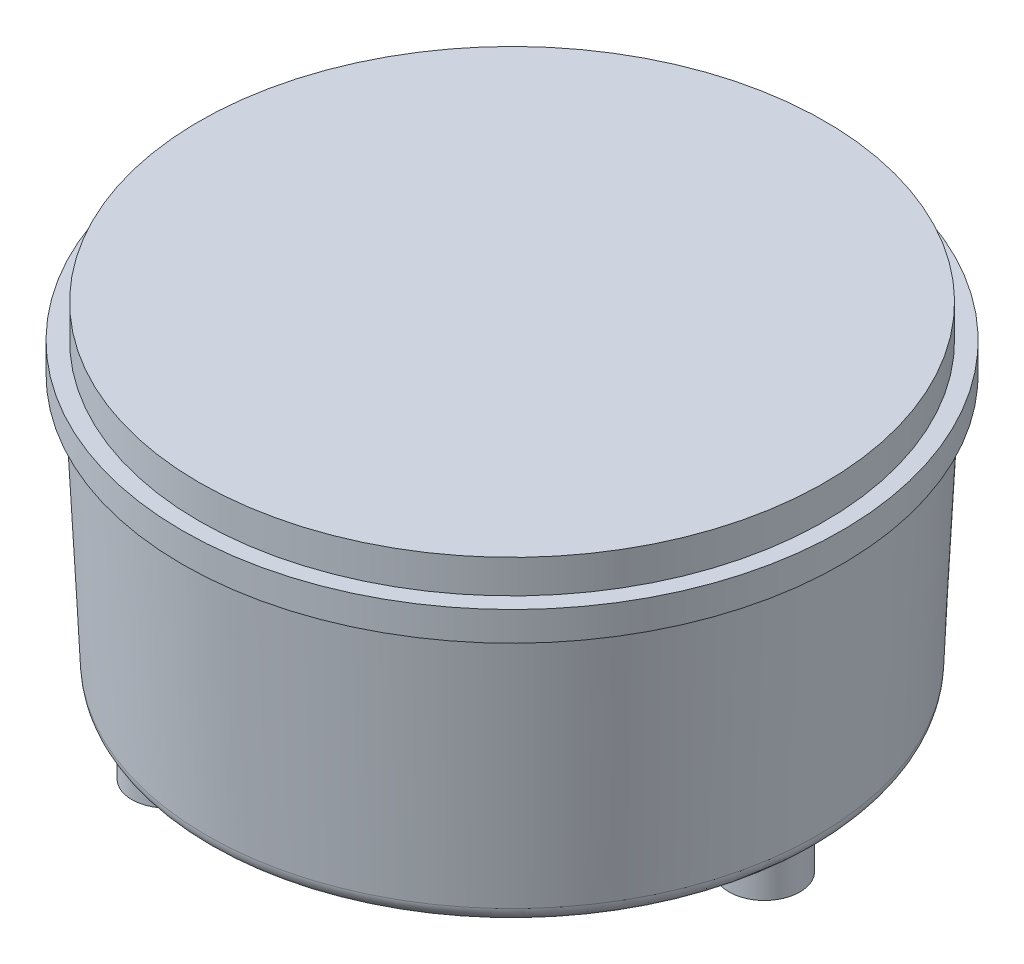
ISO-10303-21;
HEADER;
FILE_DESCRIPTION(('STEP AP214'),'2;1');
FILE_NAME('part.step','',(''),(''),'','','');
FILE_SCHEMA(('AUTOMOTIVE_DESIGN { 1 0 10303 214 1 1 1 1 }'));
ENDSEC;
DATA;
#1=APPLICATION_CONTEXT('core data for automotive mechanical design processes');
#2=APPLICATION_PROTOCOL_DEFINITION('international standard','automotive_design',2000,#1);
#3=PRODUCT_CONTEXT('',#1,'mechanical');
#4=PRODUCT('Part','Part','',(#3));
#5=PRODUCT_RELATED_PRODUCT_CATEGORY('part','',(#4));
#6=PRODUCT_DEFINITION_FORMATION('','',#4);
#7=PRODUCT_DEFINITION_CONTEXT('part definition',#1,'design');
#8=PRODUCT_DEFINITION('design','',#6,#7);
#9=PRODUCT_DEFINITION_SHAPE('','',#8);
#10=(LENGTH_UNIT() NAMED_UNIT(*) SI_UNIT(.MILLI.,.METRE.));
#11=(NAMED_UNIT(*) PLANE_ANGLE_UNIT() SI_UNIT($,.RADIAN.));
#12=(NAMED_UNIT(*) SI_UNIT($,.STERADIAN.) SOLID_ANGLE_UNIT());
#13=UNCERTAINTY_MEASURE_WITH_UNIT(LENGTH_MEASURE(1.E-05),#10,'distance_accuracy_value','');
#14=(GEOMETRIC_REPRESENTATION_CONTEXT(3) GLOBAL_UNCERTAINTY_ASSIGNED_CONTEXT((#13)) GLOBAL_UNIT_ASSIGNED_CONTEXT((#10,
#11,#12)) REPRESENTATION_CONTEXT('',''));
#15=CARTESIAN_POINT('',(0.,0.,0.));
#16=DIRECTION('',(0.,0.,1.));
#17=DIRECTION('',(1.,0.,0.));
#18=AXIS2_PLACEMENT_3D('',#15,#16,#17);
#19=CARTESIAN_POINT('',(-19.75,-35.,0.));
#20=DIRECTION('',(0.,-1.,0.));
#21=DIRECTION('',(0.,0.,-1.));
#22=AXIS2_PLACEMENT_3D('',#19,#20,#21);
#23=PLANE('',#22);
#24=CARTESIAN_POINT('',(0.,-35.,0.));
#25=DIRECTION('',(0.,1.,0.));
#26=DIRECTION('',(0.,0.,1.));
#27=AXIS2_PLACEMENT_3D('',#24,#25,#26);
#28=CIRCLE('',#27,34.5929718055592);
#29=CARTESIAN_POINT('',(-19.9535349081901,-35.,-28.2582756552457));
#30=VERTEX_POINT('',#29);
#31=CARTESIAN_POINT('',(-19.9535349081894,-35.,28.2582756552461));
#32=VERTEX_POINT('',#31);
#33=EDGE_CURVE('E229',#30,#32,#28,.T.);
#34=ORIENTED_EDGE('',*,*,#33,.F.);
#35=CARTESIAN_POINT('',(-15.1249999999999,-35.,-26.1972684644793));
#36=DIRECTION('',(0.,-1.,0.));
#37=DIRECTION('',(0.,0.,-1.));
#38=AXIS2_PLACEMENT_3D('',#35,#36,#37);
#39=CIRCLE('',#38,5.25000000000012);
#40=CARTESIAN_POINT('',(-14.4956171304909,-35.,-31.4094059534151));
#41=VERTEX_POINT('',#40);
#42=EDGE_CURVE('E257',#30,#41,#39,.F.);
#43=ORIENTED_EDGE('',*,*,#42,.T.);
#44=CARTESIAN_POINT('',(34.4491520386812,-35.,-3.1511302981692));
#45=VERTEX_POINT('',#44);
#46=EDGE_CURVE('E225',#45,#41,#28,.T.);
#47=ORIENTED_EDGE('',*,*,#46,.F.);
#48=CARTESIAN_POINT('',(30.25,-35.,0.));
#49=DIRECTION('',(0.,-1.,0.));
#50=DIRECTION('',(0.,0.,-1.));
#51=AXIS2_PLACEMENT_3D('',#48,#49,#50);
#52=CIRCLE('',#51,5.25000000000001);
#53=CARTESIAN_POINT('',(34.4491520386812,-35.,3.1511302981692));
#54=VERTEX_POINT('',#53);
#55=EDGE_CURVE('E113',#45,#54,#52,.F.);
#56=ORIENTED_EDGE('',*,*,#55,.T.);
#57=CARTESIAN_POINT('',(-14.4956171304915,-35.,31.4094059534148));
#58=VERTEX_POINT('',#57);
#59=EDGE_CURVE('E226',#58,#54,#28,.T.);
#60=ORIENTED_EDGE('',*,*,#59,.F.);
#61=CARTESIAN_POINT('',(-15.1249999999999,-35.,26.1972684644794));
#62=DIRECTION('',(0.,-1.,0.));
#63=DIRECTION('',(0.,0.,-1.));
#64=AXIS2_PLACEMENT_3D('',#61,#62,#63);
#65=CIRCLE('',#64,5.24999999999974);
#66=EDGE_CURVE('E115',#58,#32,#65,.F.);
#67=ORIENTED_EDGE('',*,*,#66,.T.);
#68=EDGE_LOOP('',(#34,#43,#47,#56,#60,#67));
#69=FACE_BOUND('',#68,.T.);
#70=ADVANCED_FACE('F34',(#69),#23,.T.);
#71=CARTESIAN_POINT('',(-19.7499999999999,-3.5,0.));
#72=DIRECTION('',(0.,-1.,0.));
#73=DIRECTION('',(0.,0.,-1.));
#74=AXIS2_PLACEMENT_3D('',#71,#72,#73);
#75=PLANE('',#74);
#76=CARTESIAN_POINT('',(0.,-3.5,0.));
#77=DIRECTION('',(0.,1.,0.));
#78=DIRECTION('',(0.,0.,1.));
#79=AXIS2_PLACEMENT_3D('',#76,#77,#78);
#80=CIRCLE('',#79,38.9535140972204);
#81=CARTESIAN_POINT('',(0.,-3.5,38.9535140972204));
#82=VERTEX_POINT('',#81);
#83=EDGE_CURVE('E209',#82,#82,#80,.T.);
#84=ORIENTED_EDGE('',*,*,#83,.T.);
#85=EDGE_LOOP('',(#84));
#86=FACE_BOUND('',#85,.T.);
#87=CARTESIAN_POINT('',(0.,-3.5,0.));
#88=DIRECTION('',(0.,1.,0.));
#89=DIRECTION('',(0.,0.,1.));
#90=AXIS2_PLACEMENT_3D('',#87,#88,#89);
#91=CIRCLE('',#90,39.5);
#92=CARTESIAN_POINT('',(0.,-3.5,39.5));
#93=VERTEX_POINT('',#92);
#94=EDGE_CURVE('E239',#93,#93,#91,.T.);
#95=ORIENTED_EDGE('',*,*,#94,.F.);
#96=EDGE_LOOP('',(#95));
#97=FACE_BOUND('',#96,.T.);
#98=ADVANCED_FACE('F131',(#86,#97),#75,.T.);
#99=CARTESIAN_POINT('',(0.,-4.5,0.));
#100=DIRECTION('',(0.,1.,0.));
#101=DIRECTION('',(0.,0.,1.));
#102=AXIS2_PLACEMENT_3D('',#99,#100,#101);
#103=TOROIDAL_SURFACE('',#102,38.9535140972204,0.999999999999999);
#104=CARTESIAN_POINT('',(0.,-4.45243485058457,0.));
#105=DIRECTION('',(0.,1.,0.));
#106=DIRECTION('',(0.,0.,1.));
#107=AXIS2_PLACEMENT_3D('',#104,#105,#106);
#108=CIRCLE('',#107,37.954645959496);
#109=CARTESIAN_POINT('',(0.,-4.45243485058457,37.954645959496));
#110=VERTEX_POINT('',#109);
#111=EDGE_CURVE('E214',#110,#110,#108,.T.);
#112=ORIENTED_EDGE('',*,*,#111,.T.);
#113=EDGE_LOOP('',(#112));
#114=FACE_BOUND('',#113,.T.);
#115=ORIENTED_EDGE('',*,*,#83,.F.);
#116=EDGE_LOOP('',(#115));
#117=FACE_BOUND('',#116,.T.);
#118=ADVANCED_FACE('F184',(#114,#117),#103,.F.);
#119=CARTESIAN_POINT('',(0.,-4.45243485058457,0.));
#120=DIRECTION('',(0.,1.,0.));
#121=DIRECTION('',(0.,0.,1.));
#122=AXIS2_PLACEMENT_3D('',#119,#120,#121);
#123=CONICAL_SURFACE('',#122,37.954645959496,0.0475831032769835);
#124=CARTESIAN_POINT('',(0.,-33.0951302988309,0.));
#125=DIRECTION('',(0.,1.,0.));
#126=DIRECTION('',(0.,0.,1.));
#127=AXIS2_PLACEMENT_3D('',#124,#125,#126);
#128=CIRCLE('',#127,36.590708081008);
#129=CARTESIAN_POINT('',(0.,-33.0951302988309,36.590708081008));
#130=VERTEX_POINT('',#129);
#131=EDGE_CURVE('E222',#130,#130,#128,.T.);
#132=ORIENTED_EDGE('',*,*,#131,.T.);
#133=EDGE_LOOP('',(#132));
#134=FACE_BOUND('',#133,.T.);
#135=ORIENTED_EDGE('',*,*,#111,.F.);
#136=EDGE_LOOP('',(#135));
#137=FACE_BOUND('',#136,.T.);
#138=ADVANCED_FACE('F351',(#134,#137),#123,.T.);
#139=CARTESIAN_POINT('',(0.,-33.,0.));
#140=DIRECTION('',(0.,1.,0.));
#141=DIRECTION('',(0.,0.,1.));
#142=AXIS2_PLACEMENT_3D('',#139,#140,#141);
#143=TOROIDAL_SURFACE('',#142,34.5929718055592,2.);
#144=ORIENTED_EDGE('',*,*,#46,.T.);
#145=CARTESIAN_POINT('',(-19.3475700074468,-35.8444399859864,-26.6793499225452));
#146=CARTESIAN_POINT('',(-19.3141790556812,-34.6293949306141,-26.9718225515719));
#147=CARTESIAN_POINT('',(-20.5333032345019,-34.8962933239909,-27.0459249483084));
#148=CARTESIAN_POINT('',(-19.336143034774,-35.8746927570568,-26.7798122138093));
#149=CARTESIAN_POINT('',(-19.3004531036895,-34.6711310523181,-27.0310423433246));
#150=CARTESIAN_POINT('',(-20.5003329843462,-34.9164618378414,-27.1465468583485));
#151=CARTESIAN_POINT('',(-19.3209413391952,-35.8995436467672,-26.8807975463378));
#152=CARTESIAN_POINT('',(-19.2851911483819,-34.7110641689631,-27.0958621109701));
#153=CARTESIAN_POINT('',(-20.4632604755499,-34.9330290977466,-27.2482078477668));
#154=CARTESIAN_POINT('',(-19.2830614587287,-35.9400289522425,-27.0823813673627));
#155=CARTESIAN_POINT('',(-19.250105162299,-34.7852344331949,-27.2337438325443));
#156=CARTESIAN_POINT('',(-20.3812477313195,-34.960019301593,-27.4521621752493));
#157=CARTESIAN_POINT('',(-19.2603980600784,-35.9556814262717,-27.1829802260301));
#158=CARTESIAN_POINT('',(-19.2304052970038,-34.8195581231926,-27.3065382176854));
#159=CARTESIAN_POINT('',(-20.3363231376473,-34.9704542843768,-27.5544538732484));
#160=CARTESIAN_POINT('',(-19.2078388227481,-35.9793660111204,-27.381944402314));
#161=CARTESIAN_POINT('',(-19.185138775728,-34.8816001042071,-27.4581191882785));
#162=CARTESIAN_POINT('',(-20.2392109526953,-34.9862440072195,-27.757792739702));
#163=CARTESIAN_POINT('',(-19.1780038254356,-35.9874595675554,-27.4803212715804));
#164=CARTESIAN_POINT('',(-19.1597527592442,-34.9094890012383,-27.536690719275));
#165=CARTESIAN_POINT('',(-20.1870859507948,-34.9916397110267,-27.8588432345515));
#166=CARTESIAN_POINT('',(-19.1112063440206,-35.997775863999,-27.6748496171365));
#167=CARTESIAN_POINT('',(-19.1021327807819,-34.9590677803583,-27.6981164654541));
#168=CARTESIAN_POINT('',(-20.0756366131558,-34.9985172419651,-28.059681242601));
#169=CARTESIAN_POINT('',(-19.0742404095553,-35.9999957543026,-27.7709999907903));
#170=CARTESIAN_POINT('',(-19.0700170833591,-34.9808905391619,-27.7809285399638));
#171=CARTESIAN_POINT('',(-20.0163087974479,-34.9999971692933,-28.15946811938));
#172=CARTESIAN_POINT('',(-18.9532774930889,-36.0000084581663,-28.054367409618));
#173=CARTESIAN_POINT('',(-18.963696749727,-35.0370106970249,-28.0298915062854));
#174=CARTESIAN_POINT('',(-19.8284784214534,-35.0000056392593,-28.4551174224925));
#175=CARTESIAN_POINT('',(-18.8590071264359,-35.9912235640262,-28.2372871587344));
#176=CARTESIAN_POINT('',(-18.8779528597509,-35.0639813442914,-28.2021025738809));
#177=CARTESIAN_POINT('',(-19.6897453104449,-34.994149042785,-28.648072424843));
#178=CARTESIAN_POINT('',(-18.6450482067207,-35.9660305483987,-28.5876765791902));
#179=CARTESIAN_POINT('',(-18.6756052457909,-35.1012476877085,-28.5416823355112));
#180=CARTESIAN_POINT('',(-19.3874667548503,-34.9773536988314,-29.0220600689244));
#181=CARTESIAN_POINT('',(-18.5252997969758,-35.9496043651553,-28.7551085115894));
#182=CARTESIAN_POINT('',(-18.5591743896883,-35.1121265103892,-28.7103185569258));
#183=CARTESIAN_POINT('',(-19.2238631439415,-34.9664029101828,-29.2030632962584));
#184=CARTESIAN_POINT('',(-18.3198755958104,-35.9242527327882,-29.0024077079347));
#185=CARTESIAN_POINT('',(-18.3540060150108,-35.1221824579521,-28.9635549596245));
#186=CARTESIAN_POINT('',(-18.9505502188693,-34.9495018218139,-29.4742534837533));
#187=CARTESIAN_POINT('',(-18.2419202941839,-35.9151613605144,-29.0887803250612));
#188=CARTESIAN_POINT('',(-18.2755853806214,-35.1244244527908,-29.052629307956));
#189=CARTESIAN_POINT('',(-18.8482068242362,-34.9434409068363,-29.5698065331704));
#190=CARTESIAN_POINT('',(-18.0791529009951,-35.8982971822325,-29.2548800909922));
#191=CARTESIAN_POINT('',(-18.1104728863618,-35.1272505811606,-29.2246965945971));
#192=CARTESIAN_POINT('',(-18.6370347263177,-34.932198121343,-29.7553286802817));
#193=CARTESIAN_POINT('',(-17.9943427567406,-35.8905240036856,-29.3346091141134));
#194=CARTESIAN_POINT('',(-18.0236394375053,-35.1278549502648,-29.3079826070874));
#195=CARTESIAN_POINT('',(-18.5282078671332,-34.9270160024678,-29.8452993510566));
#196=CARTESIAN_POINT('',(-17.8184389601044,-35.8772489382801,-29.4868601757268));
#197=CARTESIAN_POINT('',(-17.8425529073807,-35.1283474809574,-29.4672489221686));
#198=CARTESIAN_POINT('',(-18.3047036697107,-34.9181659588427,-30.0190689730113));
#199=CARTESIAN_POINT('',(-17.7273479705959,-35.8717460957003,-29.5593852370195));
#200=CARTESIAN_POINT('',(-17.7480967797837,-35.1282414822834,-29.5435071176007));
#201=CARTESIAN_POINT('',(-18.1900288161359,-34.9144973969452,-30.1028705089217));
#202=CARTESIAN_POINT('',(-17.5394998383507,-35.8636493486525,-29.6967286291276));
#203=CARTESIAN_POINT('',(-17.5527664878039,-35.1279583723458,-29.6877335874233));
#204=CARTESIAN_POINT('',(-17.9555014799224,-34.9090995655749,-30.2637755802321));
#205=CARTESIAN_POINT('',(-17.4427448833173,-35.8610543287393,-29.7615499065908));
#206=CARTESIAN_POINT('',(-17.4516351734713,-35.1277811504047,-29.755946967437));
#207=CARTESIAN_POINT('',(-17.8356510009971,-34.9073695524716,-30.3408816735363));
#208=CARTESIAN_POINT('',(-17.2429508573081,-35.8590570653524,-29.8838218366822));
#209=CARTESIAN_POINT('',(-17.2427243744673,-35.1276522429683,-29.8841245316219));
#210=CARTESIAN_POINT('',(-17.5899138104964,-34.9060380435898,-30.4888681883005));
#211=CARTESIAN_POINT('',(-17.1398471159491,-35.8596961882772,-29.9411673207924));
#212=CARTESIAN_POINT('',(-17.1345631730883,-35.127703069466,-29.9441754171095));
#213=CARTESIAN_POINT('',(-17.4639694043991,-34.9064641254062,-30.5596561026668));
#214=CARTESIAN_POINT('',(-16.9292683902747,-35.8641866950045,-30.0470746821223));
#215=CARTESIAN_POINT('',(-16.9140884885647,-35.1279615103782,-30.0543577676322));
#216=CARTESIAN_POINT('',(-17.2083271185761,-34.909457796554,-30.6934171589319));
#217=CARTESIAN_POINT('',(-16.8217933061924,-35.868038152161,-30.095636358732));
#218=CARTESIAN_POINT('',(-16.8014317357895,-35.128169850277,-30.1046352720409));
#219=CARTESIAN_POINT('',(-17.0786291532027,-34.912025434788,-30.7563901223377));
#220=CARTESIAN_POINT('',(-16.603150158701,-35.8785056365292,-30.1836791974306));
#221=CARTESIAN_POINT('',(-16.5732372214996,-35.1282918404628,-30.1949200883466));
#222=CARTESIAN_POINT('',(-16.816194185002,-34.9190037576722,-30.8742001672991));
#223=CARTESIAN_POINT('',(-16.4919787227,-35.8851242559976,-30.2231517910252));
#224=CARTESIAN_POINT('',(-16.4573408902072,-35.1282038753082,-30.2349996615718));
#225=CARTESIAN_POINT('',(-16.6834544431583,-34.9234161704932,-30.9290295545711));
#226=CARTESIAN_POINT('',(-16.2668106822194,-35.9003100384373,-30.2927135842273));
#227=CARTESIAN_POINT('',(-16.2241981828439,-35.1269459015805,-30.3047200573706));
#228=CARTESIAN_POINT('',(-16.4158749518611,-34.9335400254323,-31.0302000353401));
#229=CARTESIAN_POINT('',(-16.1528130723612,-35.9088779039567,-30.3227993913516));
#230=CARTESIAN_POINT('',(-16.1066018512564,-35.1257648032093,-30.3343727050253));
#231=CARTESIAN_POINT('',(-16.2810344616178,-34.9392519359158,-31.0765380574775));
#232=CARTESIAN_POINT('',(-15.8048827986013,-35.9361549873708,-30.3992984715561));
#233=CARTESIAN_POINT('',(-15.7491562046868,-35.1189284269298,-30.4086470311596));
#234=CARTESIAN_POINT('',(-15.8712299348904,-34.9574366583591,-31.2034950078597));
#235=CARTESIAN_POINT('',(-15.5676105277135,-35.9562688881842,-30.4309082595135));
#236=CARTESIAN_POINT('',(-15.5094009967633,-35.1098100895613,-30.4363237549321));
#237=CARTESIAN_POINT('',(-15.594096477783,-34.9708459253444,-31.2706613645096));
#238=CARTESIAN_POINT('',(-15.0911877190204,-35.9881883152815,-30.4537926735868));
#239=CARTESIAN_POINT('',(-15.0461095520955,-35.0721772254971,-30.453258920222));
#240=CARTESIAN_POINT('',(-15.0416032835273,-34.9921255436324,-31.3678295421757));
#241=CARTESIAN_POINT('',(-14.8520434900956,-36.0000148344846,-30.4451696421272));
#242=CARTESIAN_POINT('',(-14.8207844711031,-35.0428419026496,-30.441349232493));
#243=CARTESIAN_POINT('',(-14.7662408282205,-35.0000098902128,-31.3979254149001));
#244=CARTESIAN_POINT('',(-14.5132232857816,-35.9999935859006,-30.4042727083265));
#245=CARTESIAN_POINT('',(-14.5239269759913,-34.9808892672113,-30.4055857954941));
#246=CARTESIAN_POINT('',(-14.3786054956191,-34.9999957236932,-31.4143698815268));
#247=CARTESIAN_POINT('',(-14.4114331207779,-35.997773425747,-30.3882018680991));
#248=CARTESIAN_POINT('',(-14.4361277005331,-34.9590511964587,-30.3919808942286));
#249=CARTESIAN_POINT('',(-14.2624797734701,-34.9985156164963,-31.4158536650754));
#250=CARTESIAN_POINT('',(-14.2094989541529,-35.9874496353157,-30.3487650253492));
#251=CARTESIAN_POINT('',(-14.2674724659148,-34.9094456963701,-30.3611503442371));
#252=CARTESIAN_POINT('',(-14.032746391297,-34.991633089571,-31.4119444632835));
#253=CARTESIAN_POINT('',(-14.1093540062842,-35.9793495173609,-30.3254033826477));
#254=CARTESIAN_POINT('',(-14.1867111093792,-34.8815460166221,-30.343843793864));
#255=CARTESIAN_POINT('',(-13.9191372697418,-34.9862330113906,-31.4065555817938));
#256=CARTESIAN_POINT('',(-13.9107800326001,-35.9556551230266,-30.2714318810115));
#257=CARTESIAN_POINT('',(-14.0328239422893,-34.8195002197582,-30.3072559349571));
#258=CARTESIAN_POINT('',(-13.694500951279,-34.9704367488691,-31.3889792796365));
#259=CARTESIAN_POINT('',(-13.8123696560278,-35.9400047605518,-30.240768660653));
#260=CARTESIAN_POINT('',(-13.9599675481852,-34.785187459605,-30.287926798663));
#261=CARTESIAN_POINT('',(-13.5834997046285,-34.9600031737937,-31.3767408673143));
#262=CARTESIAN_POINT('',(-13.6189250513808,-35.8995285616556,-30.1728019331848));
#263=CARTESIAN_POINT('',(-13.8230716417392,-34.7110397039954,-30.2493846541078));
#264=CARTESIAN_POINT('',(-13.3659451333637,-34.9330190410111,-31.345795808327));
#265=CARTESIAN_POINT('',(-13.5238982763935,-35.8746836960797,-30.1354847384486));
#266=CARTESIAN_POINT('',(-13.7593267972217,-34.6711177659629,-30.2301979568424));
#267=CARTESIAN_POINT('',(-13.2594015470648,-34.916455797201,-31.3270757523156));
#268=CARTESIAN_POINT('',(-13.4312097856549,-35.8444399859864,-30.0951620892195));
#269=CARTESIAN_POINT('',(-13.7011939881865,-34.6293949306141,-30.2124809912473));
#270=CARTESIAN_POINT('',(-13.1558064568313,-34.8962933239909,-31.3053246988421));
#271=(BOUNDED_SURFACE() B_SPLINE_SURFACE(3,2,((#145,#146,#147),(#148,#149,#150),(#151,#152,
#153),(#154,#155,#156),(#157,#158,#159),(#160,#161,#162),(#163,#164,#165),(#166,#167,#168),
(#169,#170,#171),(#172,#173,#174),(#175,#176,#177),(#178,#179,#180),(#181,#182,#183),(#184,#185,
#186),(#187,#188,#189),(#190,#191,#192),(#193,#194,#195),(#196,#197,#198),(#199,#200,#201),
(#202,#203,#204),(#205,#206,#207),(#208,#209,#210),(#211,#212,#213),(#214,#215,#216),(#217,#218,
#219),(#220,#221,#222),(#223,#224,#225),(#226,#227,#228),(#229,#230,#231),(#232,#233,#234),
(#235,#236,#237),(#238,#239,#240),(#241,#242,#243),(#244,#245,#246),(#247,#248,#249),(#250,#251,
#252),(#253,#254,#255),(#256,#257,#258),(#259,#260,#261),(#262,#263,#264),(#265,#266,#267),
(#268,#269,#270)),.UNSPECIFIED.,.F.,.F.,.F.) B_SPLINE_SURFACE_WITH_KNOTS((4,2,2,2,2,2,2,2,2,2,2,
2,2,2,2,2,2,2,2,2,4),(3,3),(0.,0.385145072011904,0.769531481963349,1.15076534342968,
1.53218413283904,2.29203658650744,3.05369430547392,3.4853090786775,3.91680166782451,
4.34811242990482,4.77925768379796,5.21593134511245,5.65261497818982,6.08970861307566,
6.52696003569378,7.41172081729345,8.29423221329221,8.67581040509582,9.05716085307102,
9.44138878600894,9.82641641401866),(0.,1.),
.UNSPECIFIED.) GEOMETRIC_REPRESENTATION_ITEM() RATIONAL_B_SPLINE_SURFACE(((1.,0.62463536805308,
1.),(1.,0.63100972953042,1.),(1.,0.637709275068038,1.),(1.,0.651450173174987,1.),(1.,
0.658490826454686,1.),(1.,0.672574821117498,1.),(1.,0.679617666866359,1.),(1.,0.693535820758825,
1.),(1.,0.700411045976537,1.),(1.,0.720445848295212,1.),(1.,0.733072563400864,1.),(1.,
0.755858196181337,1.),(1.,0.766011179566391,1.),(1.,0.779463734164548,1.),(1.,0.78382663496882,
1.),(1.,0.79147292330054,1.),(1.,0.794756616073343,1.),(1.,0.800183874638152,1.),(1.,
0.802327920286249,1.),(1.,0.805439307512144,1.),(1.,0.806407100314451,1.),(1.,0.807154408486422,
1.),(1.,0.806918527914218,1.),(1.,0.805227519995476,1.),(1.,0.803772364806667,1.),(1.,
0.799667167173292,1.),(1.,0.797016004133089,1.),(1.,0.790568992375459,1.),(1.,0.786772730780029,
1.),(1.,0.773656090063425,1.),(1.,0.76265846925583,1.),(1.,0.737124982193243,1.),(1.,
0.722598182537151,1.),(1.,0.700408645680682,1.),(1.,0.693530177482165,1.),(1.,0.679606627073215,
1.),(1.,0.67256164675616,1.),(1.,0.658478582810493,1.),(1.,0.651440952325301,1.),(1.,
0.637705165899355,1.),(1.,0.631007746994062,1.),(1.,0.624635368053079,1.))) REPRESENTATION_ITEM('') SURFACE());
#272=CARTESIAN_POINT('',(-13.1558064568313,-34.8962933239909,-31.3053246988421));
#273=CARTESIAN_POINT('',(-13.2594015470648,-34.916455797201,-31.3270757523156));
#274=CARTESIAN_POINT('',(-13.3659451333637,-34.9330190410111,-31.345795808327));
#275=CARTESIAN_POINT('',(-13.5834997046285,-34.9600031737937,-31.3767408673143));
#276=CARTESIAN_POINT('',(-13.694500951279,-34.9704367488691,-31.3889792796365));
#277=CARTESIAN_POINT('',(-13.9191372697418,-34.9862330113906,-31.4065555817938));
#278=CARTESIAN_POINT('',(-14.032746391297,-34.991633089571,-31.4119444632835));
#279=CARTESIAN_POINT('',(-14.2624797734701,-34.9985156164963,-31.4158536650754));
#280=CARTESIAN_POINT('',(-14.3786054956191,-34.9999957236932,-31.4143698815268));
#281=CARTESIAN_POINT('',(-14.7662408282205,-35.0000098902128,-31.3979254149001));
#282=CARTESIAN_POINT('',(-15.0416032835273,-34.9921255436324,-31.3678295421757));
#283=CARTESIAN_POINT('',(-15.594096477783,-34.9708459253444,-31.2706613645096));
#284=CARTESIAN_POINT('',(-15.8712299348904,-34.9574366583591,-31.2034950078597));
#285=CARTESIAN_POINT('',(-16.2810344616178,-34.9392519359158,-31.0765380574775));
#286=CARTESIAN_POINT('',(-16.4158749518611,-34.9335400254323,-31.0302000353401));
#287=CARTESIAN_POINT('',(-16.6834544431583,-34.9234161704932,-30.9290295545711));
#288=CARTESIAN_POINT('',(-16.816194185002,-34.9190037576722,-30.8742001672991));
#289=CARTESIAN_POINT('',(-17.0786291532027,-34.912025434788,-30.7563901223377));
#290=CARTESIAN_POINT('',(-17.2083271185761,-34.909457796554,-30.6934171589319));
#291=CARTESIAN_POINT('',(-17.4639694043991,-34.9064641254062,-30.5596561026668));
#292=CARTESIAN_POINT('',(-17.5899138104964,-34.9060380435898,-30.4888681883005));
#293=CARTESIAN_POINT('',(-17.8356510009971,-34.9073695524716,-30.3408816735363));
#294=CARTESIAN_POINT('',(-17.9555014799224,-34.9090995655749,-30.2637755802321));
#295=CARTESIAN_POINT('',(-18.1900288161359,-34.9144973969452,-30.1028705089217));
#296=CARTESIAN_POINT('',(-18.3047036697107,-34.9181659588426,-30.0190689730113));
#297=CARTESIAN_POINT('',(-18.5282078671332,-34.9270160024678,-29.8452993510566));
#298=CARTESIAN_POINT('',(-18.6370347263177,-34.932198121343,-29.7553286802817));
#299=CARTESIAN_POINT('',(-18.8482068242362,-34.9434409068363,-29.5698065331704));
#300=CARTESIAN_POINT('',(-18.9505502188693,-34.9495018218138,-29.4742534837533));
#301=CARTESIAN_POINT('',(-19.2238631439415,-34.9664029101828,-29.2030632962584));
#302=CARTESIAN_POINT('',(-19.3874667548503,-34.9773536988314,-29.0220600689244));
#303=CARTESIAN_POINT('',(-19.6897453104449,-34.994149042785,-28.648072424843));
#304=CARTESIAN_POINT('',(-19.8284784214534,-35.0000056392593,-28.4551174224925));
#305=CARTESIAN_POINT('',(-20.0163087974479,-34.9999971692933,-28.15946811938));
#306=CARTESIAN_POINT('',(-20.0756366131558,-34.9985172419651,-28.059681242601));
#307=CARTESIAN_POINT('',(-20.1870859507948,-34.9916397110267,-27.8588432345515));
#308=CARTESIAN_POINT('',(-20.2392109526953,-34.9862440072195,-27.757792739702));
#309=CARTESIAN_POINT('',(-20.3363231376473,-34.9704542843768,-27.5544538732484));
#310=CARTESIAN_POINT('',(-20.3812477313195,-34.9600193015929,-27.4521621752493));
#311=CARTESIAN_POINT('',(-20.4632604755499,-34.9330290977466,-27.2482078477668));
#312=CARTESIAN_POINT('',(-20.5003329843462,-34.9164618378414,-27.1465468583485));
#313=CARTESIAN_POINT('',(-20.5333032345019,-34.8962933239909,-27.0459249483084));
#314=B_SPLINE_CURVE_WITH_KNOTS('',3,(#272,#273,#274,#275,#276,#277,#278,#279,#280,#281,#282,
#283,#284,#285,#286,#287,#288,#289,#290,#291,#292,#293,#294,#295,#296,#297,#298,#299,#300,#301,
#302,#303,#304,#305,#306,#307,#308,#309,#310,#311,#312,#313),.UNSPECIFIED.,.F.,.F.,(4,2,2,2,2,2,
2,2,2,2,2,2,2,2,2,2,2,2,2,2,4),(0.,0.385027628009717,0.769255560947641,1.15060600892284,
1.53218420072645,2.41469559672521,3.29945637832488,3.736707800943,4.17380143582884,
4.61048506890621,5.0471587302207,5.47830398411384,5.90961474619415,6.34110733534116,
6.77272210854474,7.53437982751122,8.29423228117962,8.67565107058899,9.05688493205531,
9.44127134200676,9.82641641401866),.UNSPECIFIED.);
#315=EDGE_CURVE('E99',#41,#30,#314,.T.);
#316=ORIENTED_EDGE('',*,*,#315,.T.);
#317=ORIENTED_EDGE('',*,*,#33,.T.);
#318=CARTESIAN_POINT('',(-13.4312097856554,-35.8444399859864,30.0951620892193));
#319=CARTESIAN_POINT('',(-13.7011939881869,-34.6293949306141,30.2124809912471));
#320=CARTESIAN_POINT('',(-13.1558064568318,-34.8962933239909,31.3053246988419));
#321=CARTESIAN_POINT('',(-13.5239261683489,-35.8746927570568,30.1354971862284));
#322=CARTESIAN_POINT('',(-13.7593428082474,-34.6711310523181,30.2302038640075));
#323=CARTESIAN_POINT('',(-13.2594327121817,-34.9164618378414,31.327082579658));
#324=CARTESIAN_POINT('',(-13.6189828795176,-35.8995436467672,30.1728247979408));
#325=CARTESIAN_POINT('',(-13.8231093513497,-34.7110641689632,30.2493965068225));
#326=CARTESIAN_POINT('',(-13.3660099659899,-34.9330290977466,31.3458073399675));
#327=CARTESIAN_POINT('',(-13.8124995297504,-35.9400289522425,30.2408117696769));
#328=CARTESIAN_POINT('',(-13.9600614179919,-34.7852344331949,30.2879520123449));
#329=CARTESIAN_POINT('',(-13.5836459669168,-34.960019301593,31.3767593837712));
#330=CARTESIAN_POINT('',(-13.9109523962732,-35.9556814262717,30.2714841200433));
#331=CARTESIAN_POINT('',(-14.0329531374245,-34.8195581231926,30.3072886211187));
#332=CARTESIAN_POINT('',(-13.6946954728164,-34.9704542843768,31.3889993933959));
#333=CARTESIAN_POINT('',(-14.1095400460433,-35.9793660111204,30.3254485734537));
#334=CARTESIAN_POINT('',(-14.1868593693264,-34.8816001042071,30.3438771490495));
#335=CARTESIAN_POINT('',(-13.9193481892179,-34.9862440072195,31.4065672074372));
#336=CARTESIAN_POINT('',(-14.209654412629,-35.9874595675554,30.3487991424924));
#337=CARTESIAN_POINT('',(-14.2675973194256,-34.9094890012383,30.3611779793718));
#338=CARTESIAN_POINT('',(-14.0329229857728,-34.9916397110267,31.4119508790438));
#339=CARTESIAN_POINT('',(-14.4115196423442,-35.997775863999,30.3882149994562));
#340=CARTESIAN_POINT('',(-14.4362061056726,-34.9590677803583,30.3919904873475));
#341=CARTESIAN_POINT('',(-14.2625784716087,-34.9985172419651,31.4158519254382));
#342=CARTESIAN_POINT('',(-14.5132712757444,-35.9999957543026,30.4042767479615));
#343=CARTESIAN_POINT('',(-14.5239813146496,-34.9808905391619,30.4055835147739));
#344=CARTESIAN_POINT('',(-14.3786603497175,-34.9999971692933,31.4143659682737));
#345=CARTESIAN_POINT('',(-14.8191561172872,-36.0000084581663,30.4412034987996));
#346=CARTESIAN_POINT('',(-14.7927497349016,-35.0370106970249,30.4379888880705));
#347=CARTESIAN_POINT('',(-14.7286153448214,-35.0000056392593,31.3995247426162));
#348=CARTESIAN_POINT('',(-15.0247044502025,-35.9912235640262,30.4510228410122));
#349=CARTESIAN_POINT('',(-14.9847608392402,-35.0639813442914,30.4498380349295));
#350=CARTESIAN_POINT('',(-14.9650858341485,-34.994149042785,31.3758558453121));
#351=CARTESIAN_POINT('',(-15.435130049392,-35.9660305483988,30.4409236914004));
#352=CARTESIAN_POINT('',(-15.3800193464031,-35.1012476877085,30.4443897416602));
#353=CARTESIAN_POINT('',(-15.4401079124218,-34.9773536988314,31.3010687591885));
#354=CARTESIAN_POINT('',(-15.6400045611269,-35.9496043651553,30.4209344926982));
#355=CARTESIAN_POINT('',(-15.5842780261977,-35.1121265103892,30.4278757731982));
#356=CARTESIAN_POINT('',(-15.6786631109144,-34.9664029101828,31.2498854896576));
#357=CARTESIAN_POINT('',(-15.9568840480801,-35.9242527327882,30.3666815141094));
#358=CARTESIAN_POINT('',(-15.9061713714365,-35.1221824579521,30.3768129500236));
#359=CARTESIAN_POINT('',(-16.0501771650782,-34.9495018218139,31.1487846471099));
#360=CARTESIAN_POINT('',(-16.0706625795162,-35.9151613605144,30.3423565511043));
#361=CARTESIAN_POINT('',(-16.0225223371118,-35.1244244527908,30.3534358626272));
#362=CARTESIAN_POINT('',(-16.1841002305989,-34.9434409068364,31.1079291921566));
#363=CARTESIAN_POINT('',(-16.2958928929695,-35.8982971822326,30.2844457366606));
#364=CARTESIAN_POINT('',(-16.254093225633,-35.1272505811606,30.2964778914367));
#365=CARTESIAN_POINT('',(-16.4503531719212,-34.932198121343,31.0178098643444));
#366=CARTESIAN_POINT('',(-16.4073453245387,-35.8905240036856,30.2508625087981));
#367=CARTESIAN_POINT('',(-16.3696377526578,-35.1278549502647,30.2629209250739));
#368=CARTESIAN_POINT('',(-16.582683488,-34.9270160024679,30.968548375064));
#369=CARTESIAN_POINT('',(-16.6271505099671,-35.8772489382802,30.1746508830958));
#370=CARTESIAN_POINT('',(-16.5981096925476,-35.1283474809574,30.1857285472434));
#371=CARTESIAN_POINT('',(-16.84492449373,-34.9181659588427,30.8618728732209));
#372=CARTESIAN_POINT('',(-16.7355045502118,-35.8717460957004,30.1320263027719));
#373=CARTESIAN_POINT('',(-16.7113792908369,-35.1282414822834,30.1420562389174));
#374=CARTESIAN_POINT('',(-16.974836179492,-34.9144973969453,30.8044623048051));
#375=CARTESIAN_POINT('',(-16.948371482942,-35.8636493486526,30.0380167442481));
#376=CARTESIAN_POINT('',(-16.9339482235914,-35.1279583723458,30.0450084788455));
#377=CARTESIAN_POINT('',(-17.2314477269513,-34.9090995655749,30.6818082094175));
#378=CARTESIAN_POINT('',(-17.0528858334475,-35.8610543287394,29.9866351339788));
#379=CARTESIAN_POINT('',(-17.0435884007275,-35.1277811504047,29.9915328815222));
#380=CARTESIAN_POINT('',(-17.3581488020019,-34.9073695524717,30.6165676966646));
#381=CARTESIAN_POINT('',(-17.258673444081,-35.8590570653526,29.8747443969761));
#382=CARTESIAN_POINT('',(-17.2590488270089,-35.1276522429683,29.8746996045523));
#383=CARTESIAN_POINT('',(-17.6091774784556,-34.9060380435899,30.4777463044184));
#384=CARTESIAN_POINT('',(-17.3598879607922,-35.8596961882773,29.8141266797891));
#385=CARTESIAN_POINT('',(-17.3651350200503,-35.127703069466,29.8110546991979));
#386=CARTESIAN_POINT('',(-17.7334538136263,-34.9064641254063,30.4040692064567));
#387=CARTESIAN_POINT('',(-17.5568957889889,-35.8641866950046,29.6847138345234));
#388=CARTESIAN_POINT('',(-17.5707930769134,-35.1279615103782,29.6752091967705));
#389=CARTESIAN_POINT('',(-17.9771154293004,-34.9094577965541,30.249557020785));
#390=CARTESIAN_POINT('',(-17.6526889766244,-35.8680381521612,29.6159185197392));
#391=CARTESIAN_POINT('',(-17.6706630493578,-35.128169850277,29.6027843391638));
#392=CARTESIAN_POINT('',(-18.0965005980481,-34.9120254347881,30.1687217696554));
#393=CARTESIAN_POINT('',(-17.8382578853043,-35.8785056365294,29.4705894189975));
#394=CARTESIAN_POINT('',(-17.8629492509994,-35.1282918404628,29.4503045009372));
#395=CARTESIAN_POINT('',(-18.329744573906,-34.9190037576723,30.0003514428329));
#396=CARTESIAN_POINT('',(-17.928027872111,-35.8851242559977,29.3940484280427));
#397=CARTESIAN_POINT('',(-17.9556073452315,-35.1282038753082,29.3699751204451));
#398=CARTESIAN_POINT('',(-18.4435980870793,-34.9234161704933,29.9128101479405));
#399=CARTESIAN_POINT('',(-18.1008541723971,-35.9003100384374,29.2338280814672));
#400=CARTESIAN_POINT('',(-18.1325583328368,-35.1269459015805,29.2029278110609));
#401=CARTESIAN_POINT('',(-18.6650040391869,-34.9335400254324,29.7316647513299));
#402=CARTESIAN_POINT('',(-18.1839080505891,-35.9088779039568,29.1501461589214));
#403=CARTESIAN_POINT('',(-18.2170364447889,-35.1257648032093,29.1159127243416));
#404=CARTESIAN_POINT('',(-18.7725541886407,-34.9392519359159,29.6380584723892));
#405=CARTESIAN_POINT('',(-18.4241233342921,-35.936154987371,28.887079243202));
#406=CARTESIAN_POINT('',(-18.4600827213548,-35.1189284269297,28.8434928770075));
#407=CARTESIAN_POINT('',(-19.0874043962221,-34.9574366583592,29.3466358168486));
#408=CARTESIAN_POINT('',(-18.5701343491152,-35.9562688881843,28.6974003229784));
#409=CARTESIAN_POINT('',(-18.6039290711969,-35.1098100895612,28.6496971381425));
#410=CARTESIAN_POINT('',(-19.2841388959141,-34.9708459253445,29.1402143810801));
#411=CARTESIAN_POINT('',(-18.8281642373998,-35.9881883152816,28.2962482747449));
#412=CARTESIAN_POINT('',(-18.850241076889,-35.0721772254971,28.2569425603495));
#413=CARTESIAN_POINT('',(-19.6445356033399,-34.9921255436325,28.7103253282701));
#414=CARTESIAN_POINT('',(-18.9402685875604,-36.0000148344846,28.0848317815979));
#415=CARTESIAN_POINT('',(-18.9525895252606,-35.0428419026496,28.0558504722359));
#416=CARTESIAN_POINT('',(-19.8082806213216,-35.0000098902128,28.4869023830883));
#417=CARTESIAN_POINT('',(-19.0742609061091,-35.9999935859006,27.7709564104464));
#418=CARTESIAN_POINT('',(-19.0700462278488,-34.9808892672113,27.7808826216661));
#419=CARTESIAN_POINT('',(-20.0163396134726,-34.9999957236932,28.1594225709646));
#420=CARTESIAN_POINT('',(-19.1112382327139,-35.997773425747,27.6747681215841));
#421=CARTESIAN_POINT('',(-19.102163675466,-34.9590511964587,27.6980437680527));
#422=CARTESIAN_POINT('',(-20.075687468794,-34.9985156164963,28.0595966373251));
#423=CARTESIAN_POINT('',(-19.1780520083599,-35.9874496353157,27.4801695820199));
#424=CARTESIAN_POINT('',(-19.1597912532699,-34.9094456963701,27.5365687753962));
#425=CARTESIAN_POINT('',(-20.1871686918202,-34.991633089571,27.8586870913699));
#426=CARTESIAN_POINT('',(-19.2078927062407,-35.9793495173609,27.3817606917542));
#427=CARTESIAN_POINT('',(-19.1851840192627,-34.8815460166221,27.4579741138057));
#428=CARTESIAN_POINT('',(-20.2393063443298,-34.9862330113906,27.7576042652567));
#429=CARTESIAN_POINT('',(-19.2604390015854,-35.9556551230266,27.1828048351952));
#430=CARTESIAN_POINT('',(-19.2304415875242,-34.8195002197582,27.306409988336));
#431=CARTESIAN_POINT('',(-20.3364029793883,-34.9704367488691,27.5542753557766));
#432=CARTESIAN_POINT('',(-19.2830890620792,-35.9400047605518,27.0822473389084));
#433=CARTESIAN_POINT('',(-19.2501302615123,-34.785187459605,27.2336499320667));
#434=CARTESIAN_POINT('',(-20.3813048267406,-34.9600031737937,27.4520262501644));
#435=CARTESIAN_POINT('',(-19.3209504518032,-35.8995285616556,26.8807360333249));
#436=CARTESIAN_POINT('',(-19.2851997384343,-34.7110397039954,27.0958235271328));
#437=CARTESIAN_POINT('',(-20.4632829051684,-34.9330190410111,27.248145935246));
#438=CARTESIAN_POINT('',(-19.3361462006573,-35.8746836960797,26.7797818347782));
#439=CARTESIAN_POINT('',(-19.3004559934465,-34.6711177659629,27.0310255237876));
#440=CARTESIAN_POINT('',(-20.5003426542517,-34.916455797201,27.1465164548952));
#441=CARTESIAN_POINT('',(-19.3475700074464,-35.8444399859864,26.6793499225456));
#442=CARTESIAN_POINT('',(-19.3141790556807,-34.6293949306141,26.9718225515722));
#443=CARTESIAN_POINT('',(-20.5333032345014,-34.8962933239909,27.0459249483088));
#444=(BOUNDED_SURFACE() B_SPLINE_SURFACE(3,2,((#318,#319,#320),(#321,#322,#323),(#324,#325,
#326),(#327,#328,#329),(#330,#331,#332),(#333,#334,#335),(#336,#337,#338),(#339,#340,#341),
(#342,#343,#344),(#345,#346,#347),(#348,#349,#350),(#351,#352,#353),(#354,#355,#356),(#357,#358,
#359),(#360,#361,#362),(#363,#364,#365),(#366,#367,#368),(#369,#370,#371),(#372,#373,#374),
(#375,#376,#377),(#378,#379,#380),(#381,#382,#383),(#384,#385,#386),(#387,#388,#389),(#390,#391,
#392),(#393,#394,#395),(#396,#397,#398),(#399,#400,#401),(#402,#403,#404),(#405,#406,#407),
(#408,#409,#410),(#411,#412,#413),(#414,#415,#416),(#417,#418,#419),(#420,#421,#422),(#423,#424,
#425),(#426,#427,#428),(#429,#430,#431),(#432,#433,#434),(#435,#436,#437),(#438,#439,#440),
(#441,#442,#443)),.UNSPECIFIED.,.F.,.F.,.F.) B_SPLINE_SURFACE_WITH_KNOTS((4,2,2,2,2,2,2,2,2,2,2,
2,2,2,2,2,2,2,2,2,4),(3,3),(0.,0.385145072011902,0.76953148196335,1.15076534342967,
1.53218413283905,2.29203658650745,3.05369430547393,3.48530907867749,3.91680166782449,
4.34811242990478,4.7792576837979,5.21593134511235,5.65261497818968,6.08970861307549,
6.52696003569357,7.41172081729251,8.29423221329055,8.67581040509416,9.05716085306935,
9.44138878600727,9.82641641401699),(0.,1.),
.UNSPECIFIED.) GEOMETRIC_REPRESENTATION_ITEM() RATIONAL_B_SPLINE_SURFACE(((1.,0.62463536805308,
1.),(1.,0.631009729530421,1.),(1.,0.63770927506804,1.),(1.,0.651450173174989,1.),(1.,
0.658490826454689,1.),(1.,0.6725748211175,1.),(1.,0.679617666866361,1.),(1.,0.693535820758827,
1.),(1.,0.700411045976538,1.),(1.,0.720445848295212,1.),(1.,0.733072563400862,1.),(1.,
0.755858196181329,1.),(1.,0.76601117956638,1.),(1.,0.779463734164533,1.),(1.,0.783826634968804,
1.),(1.,0.79147292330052,1.),(1.,0.794756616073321,1.),(1.,0.800183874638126,1.),(1.,
0.80232792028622,1.),(1.,0.80543930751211,1.),(1.,0.806407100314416,1.),(1.,0.807154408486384,
1.),(1.,0.806918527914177,1.),(1.,0.805227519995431,1.),(1.,0.80377236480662,1.),(1.,
0.799667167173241,1.),(1.,0.797016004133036,1.),(1.,0.790568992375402,1.),(1.,0.786772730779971,
1.),(1.,0.77365609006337,1.),(1.,0.762658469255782,1.),(1.,0.737124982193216,1.),(1.,
0.722598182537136,1.),(1.,0.700408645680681,1.),(1.,0.693530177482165,1.),(1.,0.679606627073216,
1.),(1.,0.672561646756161,1.),(1.,0.658478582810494,1.),(1.,0.651440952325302,1.),(1.,
0.637705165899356,1.),(1.,0.631007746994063,1.),(1.,0.624635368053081,1.))) REPRESENTATION_ITEM('') SURFACE());
#445=CARTESIAN_POINT('',(-20.5333032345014,-34.8962933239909,27.0459249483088));
#446=CARTESIAN_POINT('',(-20.5003426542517,-34.916455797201,27.1465164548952));
#447=CARTESIAN_POINT('',(-20.4632829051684,-34.9330190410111,27.248145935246));
#448=CARTESIAN_POINT('',(-20.3813048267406,-34.9600031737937,27.4520262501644));
#449=CARTESIAN_POINT('',(-20.3364029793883,-34.9704367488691,27.5542753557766));
#450=CARTESIAN_POINT('',(-20.2393063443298,-34.9862330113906,27.7576042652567));
#451=CARTESIAN_POINT('',(-20.1871686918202,-34.991633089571,27.8586870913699));
#452=CARTESIAN_POINT('',(-20.075687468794,-34.9985156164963,28.0595966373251));
#453=CARTESIAN_POINT('',(-20.0163396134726,-34.9999957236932,28.1594225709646));
#454=CARTESIAN_POINT('',(-19.8082806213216,-35.0000098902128,28.4869023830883));
#455=CARTESIAN_POINT('',(-19.6445356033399,-34.9921255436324,28.7103253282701));
#456=CARTESIAN_POINT('',(-19.2841388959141,-34.9708459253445,29.1402143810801));
#457=CARTESIAN_POINT('',(-19.0874043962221,-34.9574366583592,29.3466358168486));
#458=CARTESIAN_POINT('',(-18.7725541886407,-34.9392519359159,29.6380584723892));
#459=CARTESIAN_POINT('',(-18.6650040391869,-34.9335400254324,29.7316647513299));
#460=CARTESIAN_POINT('',(-18.4435980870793,-34.9234161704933,29.9128101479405));
#461=CARTESIAN_POINT('',(-18.329744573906,-34.9190037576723,30.0003514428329));
#462=CARTESIAN_POINT('',(-18.0965005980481,-34.9120254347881,30.1687217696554));
#463=CARTESIAN_POINT('',(-17.9771154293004,-34.9094577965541,30.249557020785));
#464=CARTESIAN_POINT('',(-17.7334538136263,-34.9064641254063,30.4040692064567));
#465=CARTESIAN_POINT('',(-17.6091774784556,-34.9060380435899,30.4777463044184));
#466=CARTESIAN_POINT('',(-17.3581488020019,-34.9073695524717,30.6165676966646));
#467=CARTESIAN_POINT('',(-17.2314477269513,-34.9090995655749,30.6818082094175));
#468=CARTESIAN_POINT('',(-16.974836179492,-34.9144973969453,30.8044623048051));
#469=CARTESIAN_POINT('',(-16.84492449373,-34.9181659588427,30.8618728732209));
#470=CARTESIAN_POINT('',(-16.582683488,-34.9270160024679,30.968548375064));
#471=CARTESIAN_POINT('',(-16.4503531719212,-34.932198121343,31.0178098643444));
#472=CARTESIAN_POINT('',(-16.1841002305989,-34.9434409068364,31.1079291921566));
#473=CARTESIAN_POINT('',(-16.0501771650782,-34.9495018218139,31.1487846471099));
#474=CARTESIAN_POINT('',(-15.6786631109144,-34.9664029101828,31.2498854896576));
#475=CARTESIAN_POINT('',(-15.4401079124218,-34.9773536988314,31.3010687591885));
#476=CARTESIAN_POINT('',(-14.9650858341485,-34.994149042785,31.3758558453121));
#477=CARTESIAN_POINT('',(-14.7286153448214,-35.0000056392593,31.3995247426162));
#478=CARTESIAN_POINT('',(-14.3786603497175,-34.9999971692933,31.4143659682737));
#479=CARTESIAN_POINT('',(-14.2625784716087,-34.9985172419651,31.4158519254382));
#480=CARTESIAN_POINT('',(-14.0329229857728,-34.9916397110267,31.4119508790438));
#481=CARTESIAN_POINT('',(-13.9193481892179,-34.9862440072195,31.4065672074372));
#482=CARTESIAN_POINT('',(-13.6946954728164,-34.9704542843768,31.3889993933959));
#483=CARTESIAN_POINT('',(-13.5836459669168,-34.960019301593,31.3767593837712));
#484=CARTESIAN_POINT('',(-13.3660099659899,-34.9330290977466,31.3458073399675));
#485=CARTESIAN_POINT('',(-13.2594327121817,-34.9164618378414,31.327082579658));
#486=CARTESIAN_POINT('',(-13.1558064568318,-34.8962933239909,31.3053246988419));
#487=B_SPLINE_CURVE_WITH_KNOTS('',3,(#445,#446,#447,#448,#449,#450,#451,#452,#453,#454,#455,
#456,#457,#458,#459,#460,#461,#462,#463,#464,#465,#466,#467,#468,#469,#470,#471,#472,#473,#474,
#475,#476,#477,#478,#479,#480,#481,#482,#483,#484,#485,#486),.UNSPECIFIED.,.F.,.F.,(4,2,2,2,2,2,
2,2,2,2,2,2,2,2,2,2,2,2,2,2,4),(0.,0.385027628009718,0.769255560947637,1.15060600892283,
1.53218420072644,2.41469559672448,3.29945637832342,3.7367078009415,4.17380143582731,
4.61048506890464,5.04715873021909,5.47830398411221,5.9096147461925,6.3411073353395,
6.77272210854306,7.53437982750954,8.29423228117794,8.67565107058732,9.05688493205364,
9.44127134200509,9.82641641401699),.UNSPECIFIED.);
#488=EDGE_CURVE('E269',#32,#58,#487,.T.);
#489=ORIENTED_EDGE('',*,*,#488,.T.);
#490=ORIENTED_EDGE('',*,*,#59,.T.);
#491=CARTESIAN_POINT('',(32.778779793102,-35.8444399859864,-3.41581216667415));
#492=CARTESIAN_POINT('',(33.0153730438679,-34.6293949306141,-3.24065843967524));
#493=CARTESIAN_POINT('',(33.6891096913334,-34.8962933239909,-4.25939975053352));
#494=CARTESIAN_POINT('',(32.8600692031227,-35.8746927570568,-3.3556849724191));
#495=CARTESIAN_POINT('',(33.0597959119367,-34.6711310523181,-3.19916152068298));
#496=CARTESIAN_POINT('',(33.7597656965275,-34.9164618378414,-4.18053572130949));
#497=CARTESIAN_POINT('',(32.9399242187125,-35.8995436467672,-3.29202725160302));
#498=CARTESIAN_POINT('',(33.1083004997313,-34.7110641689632,-3.15353439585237));
#499=CARTESIAN_POINT('',(33.8292704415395,-34.9330290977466,-4.09759949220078));
#500=CARTESIAN_POINT('',(33.0955609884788,-35.9400289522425,-3.15843040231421));
#501=CARTESIAN_POINT('',(33.2101665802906,-34.7852344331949,-3.05420817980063));
#502=CARTESIAN_POINT('',(33.964893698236,-34.960019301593,-3.92459720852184));
#503=CARTESIAN_POINT('',(33.1713504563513,-35.9556814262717,-3.08850389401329));
#504=CARTESIAN_POINT('',(33.2633584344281,-34.8195581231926,-3.00075040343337));
#505=CARTESIAN_POINT('',(34.0310186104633,-34.9704542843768,-3.83454552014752));
#506=CARTESIAN_POINT('',(33.3173788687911,-35.9793660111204,-2.94350417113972));
#507=CARTESIAN_POINT('',(33.3719981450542,-34.8816001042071,-2.88575796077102));
#508=CARTESIAN_POINT('',(34.1585591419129,-34.9862440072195,-3.64877446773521));
#509=CARTESIAN_POINT('',(33.3876582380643,-35.9874595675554,-2.86847787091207));
#510=CARTESIAN_POINT('',(33.4273500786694,-34.9094890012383,-2.82448726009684));
#511=CARTESIAN_POINT('',(34.2200089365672,-34.9916397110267,-3.55310764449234));
#512=CARTESIAN_POINT('',(33.5227259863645,-35.997775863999,-2.7133653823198));
#513=CARTESIAN_POINT('',(33.5383388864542,-34.9590677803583,-2.69387402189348));
#514=CARTESIAN_POINT('',(34.3382150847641,-34.9985172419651,-3.35617068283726));
#515=CARTESIAN_POINT('',(33.5875116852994,-35.9999957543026,-2.63327675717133));
#516=CARTESIAN_POINT('',(33.5939983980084,-34.9808905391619,-2.62465497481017));
#517=CARTESIAN_POINT('',(34.394969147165,-34.9999971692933,-3.25489784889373));
#518=CARTESIAN_POINT('',(33.7724336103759,-36.0000084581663,-2.38683608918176));
#519=CARTESIAN_POINT('',(33.7564464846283,-35.0370106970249,-2.40809738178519));
#520=CARTESIAN_POINT('',(34.5570937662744,-35.0000056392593,-2.94440732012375));
#521=CARTESIAN_POINT('',(33.883711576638,-35.9912235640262,-2.21373568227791));
#522=CARTESIAN_POINT('',(33.8627136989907,-35.0639813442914,-2.2477354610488));
#523=CARTESIAN_POINT('',(34.654831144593,-34.994149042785,-2.72778342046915));
#524=CARTESIAN_POINT('',(34.0801782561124,-35.9660305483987,-1.85324711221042));
#525=CARTESIAN_POINT('',(34.0556245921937,-35.1012476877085,-1.90270740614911));
#526=CARTESIAN_POINT('',(34.8275746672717,-34.9773536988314,-2.2790086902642));
#527=CARTESIAN_POINT('',(34.1653043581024,-35.9496043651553,-1.66582598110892));
#528=CARTESIAN_POINT('',(34.1434524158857,-35.1121265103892,-1.71755721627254));
#529=CARTESIAN_POINT('',(34.9025262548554,-34.9664029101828,-2.04682219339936));
#530=CARTESIAN_POINT('',(34.2767596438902,-35.9242527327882,-1.3642738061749));
#531=CARTESIAN_POINT('',(34.2601773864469,-35.1221824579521,-1.41325799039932));
#532=CARTESIAN_POINT('',(35.000727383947,-34.9495018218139,-1.67453116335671));
#533=CARTESIAN_POINT('',(34.3125828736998,-35.9151613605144,-1.25357622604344));
#534=CARTESIAN_POINT('',(34.2981077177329,-35.1244244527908,-1.30080655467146));
#535=CARTESIAN_POINT('',(35.0323070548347,-34.9434409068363,-1.53812265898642));
#536=CARTESIAN_POINT('',(34.3750457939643,-35.8982971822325,-1.02956564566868));
#537=CARTESIAN_POINT('',(34.3645661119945,-35.1272505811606,-1.07178129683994));
#538=CARTESIAN_POINT('',(35.0873878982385,-34.932198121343,-1.26248118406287));
#539=CARTESIAN_POINT('',(34.401688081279,-35.8905240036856,-0.916253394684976));
#540=CARTESIAN_POINT('',(34.3932771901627,-35.1278549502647,-0.954938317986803));
#541=CARTESIAN_POINT('',(35.1108913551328,-34.9270160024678,-1.12324902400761));
#542=CARTESIAN_POINT('',(34.4455894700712,-35.8772489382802,-0.687790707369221));
#543=CARTESIAN_POINT('',(34.4406625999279,-35.1283474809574,-0.718479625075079));
#544=CARTESIAN_POINT('',(35.1496281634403,-34.9181659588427,-0.842803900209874));
#545=CARTESIAN_POINT('',(34.4628525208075,-35.8717460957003,-0.572641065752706));
#546=CARTESIAN_POINT('',(34.4594760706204,-35.1282414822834,-0.598549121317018));
#547=CARTESIAN_POINT('',(35.1648649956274,-34.9144973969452,-0.701591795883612));
#548=CARTESIAN_POINT('',(34.4878713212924,-35.8636493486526,-0.341288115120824));
#549=CARTESIAN_POINT('',(34.486714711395,-35.1279583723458,-0.357274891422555));
#550=CARTESIAN_POINT('',(35.1869492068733,-34.9090995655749,-0.418032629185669));
#551=CARTESIAN_POINT('',(34.4956307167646,-35.8610543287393,-0.225085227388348));
#552=CARTESIAN_POINT('',(34.4952235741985,-35.1277811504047,-0.235585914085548));
#553=CARTESIAN_POINT('',(35.1937998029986,-34.9073695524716,-0.275686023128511));
#554=CARTESIAN_POINT('',(34.5016243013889,-35.8590570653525,0.00907743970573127));
#555=CARTESIAN_POINT('',(34.5017732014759,-35.1276522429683,0.00942492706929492));
#556=CARTESIAN_POINT('',(35.1990912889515,-34.9060380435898,0.0111218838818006));
#557=CARTESIAN_POINT('',(34.4997350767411,-35.8596961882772,0.127040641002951));
#558=CARTESIAN_POINT('',(34.4996981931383,-35.127703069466,0.133120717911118));
#559=CARTESIAN_POINT('',(35.1974232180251,-34.9064641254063,0.155586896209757));
#560=CARTESIAN_POINT('',(34.4861641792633,-35.8641866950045,0.362360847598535));
#561=CARTESIAN_POINT('',(34.4848815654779,-35.1279615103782,0.379148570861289));
#562=CARTESIAN_POINT('',(35.1854425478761,-34.909457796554,0.44386013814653));
#563=CARTESIAN_POINT('',(34.4744822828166,-35.8680381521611,0.479717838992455));
#564=CARTESIAN_POINT('',(34.4720947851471,-35.128169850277,0.501850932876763));
#565=CARTESIAN_POINT('',(35.1751297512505,-34.912025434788,0.587668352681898));
#566=CARTESIAN_POINT('',(34.4414080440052,-35.8785056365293,0.713089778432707));
#567=CARTESIAN_POINT('',(34.4361864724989,-35.1282918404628,0.744615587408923));
#568=CARTESIAN_POINT('',(35.1459387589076,-34.9190037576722,0.873848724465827));
#569=CARTESIAN_POINT('',(34.4200065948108,-35.8851242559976,0.829103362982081));
#570=CARTESIAN_POINT('',(34.4129482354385,-35.1282038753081,0.86502454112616));
#571=CARTESIAN_POINT('',(35.1270525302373,-34.9234161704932,1.01621940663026));
#572=CARTESIAN_POINT('',(34.3676648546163,-35.9003100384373,1.05888550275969));
#573=CARTESIAN_POINT('',(34.3567565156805,-35.1269459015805,1.10179224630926));
#574=CARTESIAN_POINT('',(35.0808789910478,-34.9335400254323,1.29853528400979));
#575=CARTESIAN_POINT('',(34.3367211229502,-35.9088779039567,1.17265323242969));
#576=CARTESIAN_POINT('',(34.3236382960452,-35.1257648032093,1.2184599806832));
#577=CARTESIAN_POINT('',(35.0535886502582,-34.9392519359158,1.43847958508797));
#578=CARTESIAN_POINT('',(34.2290061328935,-35.9361549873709,1.51221922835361));
#579=CARTESIAN_POINT('',(34.2092389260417,-35.1189284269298,1.56515415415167));
#580=CARTESIAN_POINT('',(34.9586343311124,-34.9574366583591,1.85685919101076));
#581=CARTESIAN_POINT('',(34.137744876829,-35.9562688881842,1.7335079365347));
#582=CARTESIAN_POINT('',(34.1133300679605,-35.1098100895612,1.78662661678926));
#583=CARTESIAN_POINT('',(34.8782353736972,-34.9708459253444,2.13044698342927));
#584=CARTESIAN_POINT('',(33.9193519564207,-35.9881883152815,2.1575443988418));
#585=CARTESIAN_POINT('',(33.896350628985,-35.0721772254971,2.19631635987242));
#586=CARTESIAN_POINT('',(34.6861388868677,-34.9921255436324,2.65750421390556));
#587=CARTESIAN_POINT('',(33.7923120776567,-36.0000148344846,2.36033786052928));
#588=CARTESIAN_POINT('',(33.7733739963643,-35.0428419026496,2.38549876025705));
#589=CARTESIAN_POINT('',(34.5745214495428,-35.0000098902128,2.91102303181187));
#590=CARTESIAN_POINT('',(33.5874841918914,-35.9999935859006,2.63331629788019));
#591=CARTESIAN_POINT('',(33.5939732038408,-34.9808892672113,2.62470317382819));
#592=CARTESIAN_POINT('',(34.3949451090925,-34.9999957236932,3.25494731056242));
#593=CARTESIAN_POINT('',(33.5226713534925,-35.997773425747,2.71343374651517));
#594=CARTESIAN_POINT('',(33.5382913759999,-34.9590511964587,2.69393712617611));
#595=CARTESIAN_POINT('',(34.3381672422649,-34.9985156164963,3.35625702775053));
#596=CARTESIAN_POINT('',(33.3875509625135,-35.9874496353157,2.86859544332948));
#597=CARTESIAN_POINT('',(33.4272637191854,-34.9094456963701,2.82458156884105));
#598=CARTESIAN_POINT('',(34.219915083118,-34.991633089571,3.55325737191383));
#599=CARTESIAN_POINT('',(33.3172467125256,-35.9793495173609,2.94364269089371));
#600=CARTESIAN_POINT('',(33.3718951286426,-34.8815460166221,2.88586968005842));
#601=CARTESIAN_POINT('',(34.1584436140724,-34.9862330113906,3.64895131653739));
#602=CARTESIAN_POINT('',(33.1712190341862,-35.9556551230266,3.08862704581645));
#603=CARTESIAN_POINT('',(33.2632655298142,-34.8195002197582,3.00084594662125));
#604=CARTESIAN_POINT('',(34.0309039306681,-34.9704367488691,3.83470392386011));
#605=CARTESIAN_POINT('',(33.0954587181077,-35.9400047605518,3.15852132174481));
#606=CARTESIAN_POINT('',(33.2100978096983,-34.785187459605,3.05427686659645));
#607=CARTESIAN_POINT('',(33.9648045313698,-34.9600031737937,3.92471461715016));
#608=CARTESIAN_POINT('',(32.9398755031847,-35.8995285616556,3.29206589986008));
#609=CARTESIAN_POINT('',(33.1082713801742,-34.7110397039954,3.15356112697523));
#610=CARTESIAN_POINT('',(33.8292280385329,-34.9330190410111,4.09764987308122));
#611=CARTESIAN_POINT('',(32.8600444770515,-35.8746836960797,3.35570290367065));
#612=CARTESIAN_POINT('',(33.0597827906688,-34.6711177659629,3.19917243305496));
#613=CARTESIAN_POINT('',(33.7597442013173,-34.916455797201,4.18055929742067));
#614=CARTESIAN_POINT('',(32.778779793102,-35.8444399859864,3.41581216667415));
#615=CARTESIAN_POINT('',(33.0153730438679,-34.6293949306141,3.24065843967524));
#616=CARTESIAN_POINT('',(33.6891096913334,-34.8962933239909,4.25939975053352));
#617=(BOUNDED_SURFACE() B_SPLINE_SURFACE(3,2,((#491,#492,#493),(#494,#495,#496),(#497,#498,
#499),(#500,#501,#502),(#503,#504,#505),(#506,#507,#508),(#509,#510,#511),(#512,#513,#514),
(#515,#516,#517),(#518,#519,#520),(#521,#522,#523),(#524,#525,#526),(#527,#528,#529),(#530,#531,
#532),(#533,#534,#535),(#536,#537,#538),(#539,#540,#541),(#542,#543,#544),(#545,#546,#547),
(#548,#549,#550),(#551,#552,#553),(#554,#555,#556),(#557,#558,#559),(#560,#561,#562),(#563,#564,
#565),(#566,#567,#568),(#569,#570,#571),(#572,#573,#574),(#575,#576,#577),(#578,#579,#580),
(#581,#582,#583),(#584,#585,#586),(#587,#588,#589),(#590,#591,#592),(#593,#594,#595),(#596,#597,
#598),(#599,#600,#601),(#602,#603,#604),(#605,#606,#607),(#608,#609,#610),(#611,#612,#613),
(#614,#615,#616)),.UNSPECIFIED.,.F.,.F.,.F.) B_SPLINE_SURFACE_WITH_KNOTS((4,2,2,2,2,2,2,2,2,2,2,
2,2,2,2,2,2,2,2,2,4),(3,3),(0.,0.385145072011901,0.769531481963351,1.15076534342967,
1.53218413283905,2.29203658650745,3.05369430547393,3.4853090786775,3.91680166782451,
4.34811242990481,4.77925768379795,5.21593134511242,5.65261497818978,6.08970861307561,
6.52696003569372,7.41172081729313,8.29423221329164,8.67581040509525,9.05716085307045,
9.44138878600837,9.82641641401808),(0.,1.),
.UNSPECIFIED.) GEOMETRIC_REPRESENTATION_ITEM() RATIONAL_B_SPLINE_SURFACE(((1.,0.624635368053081,
1.),(1.,0.63100972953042,1.),(1.,0.637709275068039,1.),(1.,0.651450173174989,1.),(1.,
0.65849082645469,1.),(1.,0.672574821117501,1.),(1.,0.67961766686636,1.),(1.,0.693535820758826,
1.),(1.,0.700411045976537,1.),(1.,0.720445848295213,1.),(1.,0.733072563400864,1.),(1.,
0.755858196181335,1.),(1.,0.766011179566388,1.),(1.,0.779463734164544,1.),(1.,0.783826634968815,
1.),(1.,0.791472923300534,1.),(1.,0.794756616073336,1.),(1.,0.800183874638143,1.),(1.,
0.802327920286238,1.),(1.,0.805439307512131,1.),(1.,0.806407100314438,1.),(1.,0.807154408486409,
1.),(1.,0.806918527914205,1.),(1.,0.805227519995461,1.),(1.,0.803772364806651,1.),(1.,
0.799667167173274,1.),(1.,0.797016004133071,1.),(1.,0.790568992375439,1.),(1.,0.78677273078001,
1.),(1.,0.773656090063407,1.),(1.,0.762658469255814,1.),(1.,0.737124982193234,1.),(1.,
0.722598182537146,1.),(1.,0.700408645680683,1.),(1.,0.693530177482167,1.),(1.,0.679606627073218,
1.),(1.,0.672561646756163,1.),(1.,0.658478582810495,1.),(1.,0.651440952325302,1.),(1.,
0.637705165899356,1.),(1.,0.631007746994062,1.),(1.,0.624635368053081,1.))) REPRESENTATION_ITEM('') SURFACE());
#618=CARTESIAN_POINT('',(33.6891096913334,-34.8962933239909,4.25939975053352));
#619=CARTESIAN_POINT('',(33.7597442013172,-34.916455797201,4.18055929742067));
#620=CARTESIAN_POINT('',(33.8292280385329,-34.9330190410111,4.09764987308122));
#621=CARTESIAN_POINT('',(33.9648045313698,-34.9600031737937,3.92471461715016));
#622=CARTESIAN_POINT('',(34.0309039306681,-34.9704367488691,3.83470392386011));
#623=CARTESIAN_POINT('',(34.1584436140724,-34.9862330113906,3.64895131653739));
#624=CARTESIAN_POINT('',(34.219915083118,-34.991633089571,3.55325737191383));
#625=CARTESIAN_POINT('',(34.3381672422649,-34.9985156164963,3.35625702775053));
#626=CARTESIAN_POINT('',(34.3949451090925,-34.9999957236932,3.25494731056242));
#627=CARTESIAN_POINT('',(34.5745214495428,-35.0000098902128,2.91102303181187));
#628=CARTESIAN_POINT('',(34.6861388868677,-34.9921255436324,2.65750421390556));
#629=CARTESIAN_POINT('',(34.8782353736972,-34.9708459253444,2.13044698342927));
#630=CARTESIAN_POINT('',(34.9586343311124,-34.9574366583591,1.85685919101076));
#631=CARTESIAN_POINT('',(35.0535886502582,-34.9392519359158,1.43847958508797));
#632=CARTESIAN_POINT('',(35.0808789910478,-34.9335400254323,1.29853528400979));
#633=CARTESIAN_POINT('',(35.1270525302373,-34.9234161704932,1.01621940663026));
#634=CARTESIAN_POINT('',(35.1459387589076,-34.9190037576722,0.873848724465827));
#635=CARTESIAN_POINT('',(35.1751297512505,-34.912025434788,0.587668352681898));
#636=CARTESIAN_POINT('',(35.1854425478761,-34.909457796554,0.44386013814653));
#637=CARTESIAN_POINT('',(35.1974232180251,-34.9064641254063,0.155586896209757));
#638=CARTESIAN_POINT('',(35.1990912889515,-34.9060380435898,0.0111218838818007));
#639=CARTESIAN_POINT('',(35.1937998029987,-34.9073695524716,-0.275686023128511));
#640=CARTESIAN_POINT('',(35.1869492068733,-34.9090995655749,-0.418032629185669));
#641=CARTESIAN_POINT('',(35.1648649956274,-34.9144973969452,-0.701591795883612));
#642=CARTESIAN_POINT('',(35.1496281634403,-34.9181659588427,-0.842803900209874));
#643=CARTESIAN_POINT('',(35.1108913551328,-34.9270160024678,-1.12324902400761));
#644=CARTESIAN_POINT('',(35.0873878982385,-34.932198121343,-1.26248118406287));
#645=CARTESIAN_POINT('',(35.0323070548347,-34.9434409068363,-1.53812265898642));
#646=CARTESIAN_POINT('',(35.000727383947,-34.9495018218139,-1.67453116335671));
#647=CARTESIAN_POINT('',(34.9025262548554,-34.9664029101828,-2.04682219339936));
#648=CARTESIAN_POINT('',(34.8275746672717,-34.9773536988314,-2.2790086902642));
#649=CARTESIAN_POINT('',(34.654831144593,-34.994149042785,-2.72778342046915));
#650=CARTESIAN_POINT('',(34.5570937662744,-35.0000056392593,-2.94440732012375));
#651=CARTESIAN_POINT('',(34.394969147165,-34.9999971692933,-3.25489784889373));
#652=CARTESIAN_POINT('',(34.3382150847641,-34.9985172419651,-3.35617068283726));
#653=CARTESIAN_POINT('',(34.2200089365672,-34.9916397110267,-3.55310764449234));
#654=CARTESIAN_POINT('',(34.1585591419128,-34.9862440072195,-3.64877446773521));
#655=CARTESIAN_POINT('',(34.0310186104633,-34.9704542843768,-3.83454552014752));
#656=CARTESIAN_POINT('',(33.964893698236,-34.960019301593,-3.92459720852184));
#657=CARTESIAN_POINT('',(33.8292704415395,-34.9330290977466,-4.09759949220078));
#658=CARTESIAN_POINT('',(33.7597656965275,-34.9164618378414,-4.18053572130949));
#659=CARTESIAN_POINT('',(33.6891096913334,-34.8962933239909,-4.25939975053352));
#660=B_SPLINE_CURVE_WITH_KNOTS('',3,(#618,#619,#620,#621,#622,#623,#624,#625,#626,#627,#628,
#629,#630,#631,#632,#633,#634,#635,#636,#637,#638,#639,#640,#641,#642,#643,#644,#645,#646,#647,
#648,#649,#650,#651,#652,#653,#654,#655,#656,#657,#658,#659),.UNSPECIFIED.,.F.,.F.,(4,2,2,2,2,2,
2,2,2,2,2,2,2,2,2,2,2,2,2,2,4),(0.,0.385027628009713,0.769255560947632,1.15060600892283,
1.53218420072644,2.41469559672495,3.29945637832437,3.73670780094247,4.1738014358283,
4.61048506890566,5.04715873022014,5.47830398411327,5.90961474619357,6.34110733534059,
6.77272210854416,7.53437982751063,8.29423228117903,8.67565107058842,9.05688493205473,
9.44127134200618,9.82641641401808),.UNSPECIFIED.);
#661=EDGE_CURVE('E260',#54,#45,#660,.T.);
#662=ORIENTED_EDGE('',*,*,#661,.T.);
#663=EDGE_LOOP('',(#144,#316,#317,#489,#490,#662));
#664=FACE_BOUND('',#663,.T.);
#665=ORIENTED_EDGE('',*,*,#131,.F.);
#666=EDGE_LOOP('',(#665));
#667=FACE_BOUND('',#666,.T.);
#668=ADVANCED_FACE('F146',(#664,#667),#143,.T.);
#669=CARTESIAN_POINT('',(-19.75,4.,0.));
#670=DIRECTION('',(0.,1.,0.));
#671=DIRECTION('',(0.,0.,1.));
#672=AXIS2_PLACEMENT_3D('',#669,#670,#671);
#673=PLANE('',#672);
#674=CARTESIAN_POINT('',(0.,4.,0.));
#675=DIRECTION('',(0.,1.,0.));
#676=DIRECTION('',(0.,0.,1.));
#677=AXIS2_PLACEMENT_3D('',#674,#675,#676);
#678=CIRCLE('',#677,37.5);
#679=CARTESIAN_POINT('',(0.,4.,37.5));
#680=VERTEX_POINT('',#679);
#681=EDGE_CURVE('E230',#680,#680,#678,.T.);
#682=ORIENTED_EDGE('',*,*,#681,.T.);
#683=EDGE_LOOP('',(#682));
#684=FACE_BOUND('',#683,.T.);
#685=ADVANCED_FACE('F344',(#684),#673,.T.);
#686=CARTESIAN_POINT('',(0.,17.9191247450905,0.));
#687=DIRECTION('',(0.,1.,0.));
#688=DIRECTION('',(0.,0.,1.));
#689=AXIS2_PLACEMENT_3D('',#686,#687,#688);
#690=CYLINDRICAL_SURFACE('',#689,37.5);
#691=CARTESIAN_POINT('',(0.,0.,0.));
#692=DIRECTION('',(0.,1.,0.));
#693=DIRECTION('',(0.,0.,1.));
#694=AXIS2_PLACEMENT_3D('',#691,#692,#693);
#695=CIRCLE('',#694,37.5);
#696=CARTESIAN_POINT('',(0.,0.,37.5));
#697=VERTEX_POINT('',#696);
#698=EDGE_CURVE('E233',#697,#697,#695,.T.);
#699=ORIENTED_EDGE('',*,*,#698,.T.);
#700=EDGE_LOOP('',(#699));
#701=FACE_BOUND('',#700,.T.);
#702=ORIENTED_EDGE('',*,*,#681,.F.);
#703=EDGE_LOOP('',(#702));
#704=FACE_BOUND('',#703,.T.);
#705=ADVANCED_FACE('F341',(#701,#704),#690,.T.);
#706=CARTESIAN_POINT('',(-19.7500000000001,0.,0.));
#707=DIRECTION('',(0.,1.,0.));
#708=DIRECTION('',(0.,0.,1.));
#709=AXIS2_PLACEMENT_3D('',#706,#707,#708);
#710=PLANE('',#709);
#711=CARTESIAN_POINT('',(0.,0.,0.));
#712=DIRECTION('',(0.,1.,0.));
#713=DIRECTION('',(0.,0.,1.));
#714=AXIS2_PLACEMENT_3D('',#711,#712,#713);
#715=CIRCLE('',#714,39.5);
#716=CARTESIAN_POINT('',(0.,0.,39.5));
#717=VERTEX_POINT('',#716);
#718=EDGE_CURVE('E236',#717,#717,#715,.T.);
#719=ORIENTED_EDGE('',*,*,#718,.T.);
#720=EDGE_LOOP('',(#719));
#721=FACE_BOUND('',#720,.T.);
#722=ORIENTED_EDGE('',*,*,#698,.F.);
#723=EDGE_LOOP('',(#722));
#724=FACE_BOUND('',#723,.T.);
#725=ADVANCED_FACE('F337',(#721,#724),#710,.T.);
#726=CARTESIAN_POINT('',(0.,17.9191247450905,0.));
#727=DIRECTION('',(0.,1.,0.));
#728=DIRECTION('',(0.,0.,1.));
#729=AXIS2_PLACEMENT_3D('',#726,#727,#728);
#730=CYLINDRICAL_SURFACE('',#729,39.5);
#731=ORIENTED_EDGE('',*,*,#94,.T.);
#732=EDGE_LOOP('',(#731));
#733=FACE_BOUND('',#732,.T.);
#734=ORIENTED_EDGE('',*,*,#718,.F.);
#735=EDGE_LOOP('',(#734));
#736=FACE_BOUND('',#735,.T.);
#737=ADVANCED_FACE('F333',(#733,#736),#730,.T.);
#738=CARTESIAN_POINT('',(30.25,-40.,0.));
#739=DIRECTION('',(0.,-1.,0.));
#740=DIRECTION('',(0.,0.,-1.));
#741=AXIS2_PLACEMENT_3D('',#738,#739,#740);
#742=PLANE('',#741);
#743=CARTESIAN_POINT('',(30.25,-40.,0.));
#744=DIRECTION('',(0.,-1.,0.));
#745=DIRECTION('',(0.,0.,-1.));
#746=AXIS2_PLACEMENT_3D('',#743,#744,#745);
#747=CIRCLE('',#746,4.25000000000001);
#748=CARTESIAN_POINT('',(30.25,-40.,-4.25000000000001));
#749=VERTEX_POINT('',#748);
#750=EDGE_CURVE('E242',#749,#749,#747,.T.);
#751=ORIENTED_EDGE('',*,*,#750,.T.);
#752=EDGE_LOOP('',(#751));
#753=FACE_BOUND('',#752,.T.);
#754=CARTESIAN_POINT('',(30.25,-40.,0.));
#755=DIRECTION('',(0.,-1.,0.));
#756=DIRECTION('',(0.,0.,-1.));
#757=AXIS2_PLACEMENT_3D('',#754,#755,#756);
#758=CIRCLE('',#757,1.5);
#759=CARTESIAN_POINT('',(30.25,-40.,-1.5));
#760=VERTEX_POINT('',#759);
#761=EDGE_CURVE('E245',#760,#760,#758,.T.);
#762=ORIENTED_EDGE('',*,*,#761,.F.);
#763=EDGE_LOOP('',(#762));
#764=FACE_BOUND('',#763,.T.);
#765=ADVANCED_FACE('F332',(#753,#764),#742,.T.);
#766=CARTESIAN_POINT('',(30.25,-40.,0.));
#767=DIRECTION('',(0.,1.,0.));
#768=DIRECTION('',(0.,0.,1.));
#769=AXIS2_PLACEMENT_3D('',#766,#767,#768);
#770=CYLINDRICAL_SURFACE('',#769,4.25000000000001);
#771=CARTESIAN_POINT('',(30.25,-36.,0.));
#772=DIRECTION('',(0.,-1.,0.));
#773=DIRECTION('',(0.,0.,-1.));
#774=AXIS2_PLACEMENT_3D('',#771,#772,#773);
#775=CIRCLE('',#774,4.25000000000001);
#776=CARTESIAN_POINT('',(33.6493135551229,-36.,2.55091500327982));
#777=VERTEX_POINT('',#776);
#778=CARTESIAN_POINT('',(33.6493135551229,-36.,-2.55091500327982));
#779=VERTEX_POINT('',#778);
#780=EDGE_CURVE('E47',#777,#779,#775,.T.);
#781=ORIENTED_EDGE('',*,*,#780,.T.);
#782=CARTESIAN_POINT('',(32.778779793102,-35.8444399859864,-3.41581216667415));
#783=CARTESIAN_POINT('',(32.8600692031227,-35.8746927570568,-3.3556849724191));
#784=CARTESIAN_POINT('',(32.9399242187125,-35.8995436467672,-3.29202725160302));
#785=CARTESIAN_POINT('',(33.0955609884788,-35.9400289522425,-3.15843040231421));
#786=CARTESIAN_POINT('',(33.1713504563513,-35.9556814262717,-3.08850389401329));
#787=CARTESIAN_POINT('',(33.3173788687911,-35.9793660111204,-2.94350417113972));
#788=CARTESIAN_POINT('',(33.3876582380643,-35.9874595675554,-2.86847787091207));
#789=CARTESIAN_POINT('',(33.5227259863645,-35.997775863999,-2.7133653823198));
#790=CARTESIAN_POINT('',(33.5875116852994,-35.9999957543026,-2.63327675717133));
#791=CARTESIAN_POINT('',(33.7724336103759,-36.0000084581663,-2.38683608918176));
#792=CARTESIAN_POINT('',(33.883711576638,-35.9912235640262,-2.21373568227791));
#793=CARTESIAN_POINT('',(34.0801782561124,-35.9660305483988,-1.85324711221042));
#794=CARTESIAN_POINT('',(34.1653043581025,-35.9496043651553,-1.66582598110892));
#795=CARTESIAN_POINT('',(34.2767596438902,-35.9242527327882,-1.3642738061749));
#796=CARTESIAN_POINT('',(34.3125828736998,-35.9151613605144,-1.25357622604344));
#797=CARTESIAN_POINT('',(34.3750457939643,-35.8982971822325,-1.02956564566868));
#798=CARTESIAN_POINT('',(34.401688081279,-35.8905240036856,-0.916253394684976));
#799=CARTESIAN_POINT('',(34.4455894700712,-35.8772489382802,-0.687790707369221));
#800=CARTESIAN_POINT('',(34.4628525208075,-35.8717460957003,-0.572641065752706));
#801=CARTESIAN_POINT('',(34.4878713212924,-35.8636493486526,-0.341288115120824));
#802=CARTESIAN_POINT('',(34.4956307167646,-35.8610543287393,-0.225085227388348));
#803=CARTESIAN_POINT('',(34.5016243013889,-35.8590570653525,0.00907743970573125));
#804=CARTESIAN_POINT('',(34.4997350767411,-35.8596961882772,0.127040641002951));
#805=CARTESIAN_POINT('',(34.4861641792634,-35.8641866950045,0.362360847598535));
#806=CARTESIAN_POINT('',(34.4744822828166,-35.8680381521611,0.479717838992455));
#807=CARTESIAN_POINT('',(34.4414080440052,-35.8785056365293,0.713089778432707));
#808=CARTESIAN_POINT('',(34.4200065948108,-35.8851242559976,0.829103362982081));
#809=CARTESIAN_POINT('',(34.3676648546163,-35.9003100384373,1.05888550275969));
#810=CARTESIAN_POINT('',(34.3367211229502,-35.9088779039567,1.17265323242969));
#811=CARTESIAN_POINT('',(34.2290061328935,-35.9361549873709,1.51221922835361));
#812=CARTESIAN_POINT('',(34.137744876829,-35.9562688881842,1.7335079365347));
#813=CARTESIAN_POINT('',(33.9193519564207,-35.9881883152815,2.1575443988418));
#814=CARTESIAN_POINT('',(33.7923120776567,-36.0000148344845,2.36033786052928));
#815=CARTESIAN_POINT('',(33.5874841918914,-35.9999935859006,2.63331629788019));
#816=CARTESIAN_POINT('',(33.5226713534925,-35.997773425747,2.71343374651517));
#817=CARTESIAN_POINT('',(33.3875509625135,-35.9874496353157,2.86859544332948));
#818=CARTESIAN_POINT('',(33.3172467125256,-35.9793495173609,2.94364269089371));
#819=CARTESIAN_POINT('',(33.1712190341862,-35.9556551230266,3.08862704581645));
#820=CARTESIAN_POINT('',(33.0954587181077,-35.9400047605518,3.15852132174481));
#821=CARTESIAN_POINT('',(32.9398755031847,-35.8995285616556,3.29206589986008));
#822=CARTESIAN_POINT('',(32.8600444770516,-35.8746836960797,3.35570290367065));
#823=CARTESIAN_POINT('',(32.778779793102,-35.8444399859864,3.41581216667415));
#824=B_SPLINE_CURVE_WITH_KNOTS('',3,(#782,#783,#784,#785,#786,#787,#788,#789,#790,#791,#792,
#793,#794,#795,#796,#797,#798,#799,#800,#801,#802,#803,#804,#805,#806,#807,#808,#809,#810,#811,
#812,#813,#814,#815,#816,#817,#818,#819,#820,#821,#822,#823),.UNSPECIFIED.,.F.,.F.,(4,2,2,2,2,2,
2,2,2,2,2,2,2,2,2,2,2,2,2,2,4),(0.,0.385145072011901,0.769531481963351,1.15076534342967,
1.53218413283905,2.29203658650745,3.05369430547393,3.4853090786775,3.91680166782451,
4.34811242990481,4.77925768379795,5.21593134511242,5.65261497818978,6.08970861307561,
6.52696003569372,7.41172081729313,8.29423221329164,8.67581040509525,9.05716085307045,
9.44138878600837,9.82641641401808),.UNSPECIFIED.);
#825=EDGE_CURVE('E11',#779,#777,#824,.T.);
#826=ORIENTED_EDGE('',*,*,#825,.T.);
#827=EDGE_LOOP('',(#781,#826));
#828=FACE_BOUND('',#827,.T.);
#829=ORIENTED_EDGE('',*,*,#750,.F.);
#830=EDGE_LOOP('',(#829));
#831=FACE_BOUND('',#830,.T.);
#832=ADVANCED_FACE('F201',(#828,#831),#770,.T.);
#833=CARTESIAN_POINT('',(30.25,-40.,0.));
#834=DIRECTION('',(0.,1.,0.));
#835=DIRECTION('',(0.,0.,1.));
#836=AXIS2_PLACEMENT_3D('',#833,#834,#835);
#837=CYLINDRICAL_SURFACE('',#836,1.5);
#838=ORIENTED_EDGE('',*,*,#761,.T.);
#839=EDGE_LOOP('',(#838));
#840=FACE_BOUND('',#839,.T.);
#841=CARTESIAN_POINT('',(30.25,-35.,0.));
#842=DIRECTION('',(0.,-1.,0.));
#843=DIRECTION('',(0.,0.,-1.));
#844=AXIS2_PLACEMENT_3D('',#841,#842,#843);
#845=CIRCLE('',#844,1.5);
#846=CARTESIAN_POINT('',(30.25,-35.,-1.5));
#847=VERTEX_POINT('',#846);
#848=EDGE_CURVE('E206',#847,#847,#845,.F.);
#849=ORIENTED_EDGE('',*,*,#848,.T.);
#850=EDGE_LOOP('',(#849));
#851=FACE_BOUND('',#850,.T.);
#852=ADVANCED_FACE('F192',(#840,#851),#837,.F.);
#853=ORIENTED_EDGE('',*,*,#848,.F.);
#854=EDGE_LOOP('',(#853));
#855=FACE_BOUND('',#854,.T.);
#856=ADVANCED_FACE('F176',(#855),#23,.T.);
#857=CARTESIAN_POINT('',(-15.1249999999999,-40.,26.1972684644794));
#858=DIRECTION('',(0.,-1.,0.));
#859=DIRECTION('',(0.,0.,-1.));
#860=AXIS2_PLACEMENT_3D('',#857,#858,#859);
#861=PLANE('',#860);
#862=CARTESIAN_POINT('',(-15.1249999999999,-40.,26.1972684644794));
#863=DIRECTION('',(0.,-1.,0.));
#864=DIRECTION('',(0.,0.,-1.));
#865=AXIS2_PLACEMENT_3D('',#862,#863,#864);
#866=CIRCLE('',#865,4.24999999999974);
#867=CARTESIAN_POINT('',(-15.1249999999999,-40.,21.9472684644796));
#868=VERTEX_POINT('',#867);
#869=EDGE_CURVE('E248',#868,#868,#866,.T.);
#870=ORIENTED_EDGE('',*,*,#869,.T.);
#871=EDGE_LOOP('',(#870));
#872=FACE_BOUND('',#871,.T.);
#873=CARTESIAN_POINT('',(-15.1249999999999,-40.,26.1972684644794));
#874=DIRECTION('',(0.,-1.,0.));
#875=DIRECTION('',(0.,0.,-1.));
#876=AXIS2_PLACEMENT_3D('',#873,#874,#875);
#877=CIRCLE('',#876,1.49999999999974);
#878=CARTESIAN_POINT('',(-15.1249999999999,-40.,24.6972684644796));
#879=VERTEX_POINT('',#878);
#880=EDGE_CURVE('E251',#879,#879,#877,.T.);
#881=ORIENTED_EDGE('',*,*,#880,.F.);
#882=EDGE_LOOP('',(#881));
#883=FACE_BOUND('',#882,.T.);
#884=ADVANCED_FACE('F191',(#872,#883),#861,.T.);
#885=CARTESIAN_POINT('',(-15.1249999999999,-40.,26.1972684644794));
#886=DIRECTION('',(0.,1.,0.));
#887=DIRECTION('',(0.,0.,1.));
#888=AXIS2_PLACEMENT_3D('',#885,#886,#887);
#889=CYLINDRICAL_SURFACE('',#888,4.24999999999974);
#890=CARTESIAN_POINT('',(-15.1249999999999,-36.,26.1972684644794));
#891=DIRECTION('',(0.,-1.,0.));
#892=DIRECTION('',(0.,0.,-1.));
#893=AXIS2_PLACEMENT_3D('',#890,#891,#892);
#894=CIRCLE('',#893,4.24999999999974);
#895=CARTESIAN_POINT('',(-19.0338139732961,-36.,27.8657028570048));
#896=VERTEX_POINT('',#895);
#897=CARTESIAN_POINT('',(-14.6154995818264,-36.,30.4166178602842));
#898=VERTEX_POINT('',#897);
#899=EDGE_CURVE('E268',#896,#898,#894,.T.);
#900=ORIENTED_EDGE('',*,*,#899,.T.);
#901=CARTESIAN_POINT('',(-13.4312097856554,-35.8444399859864,30.0951620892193));
#902=CARTESIAN_POINT('',(-13.5239261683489,-35.8746927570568,30.1354971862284));
#903=CARTESIAN_POINT('',(-13.6189828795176,-35.8995436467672,30.1728247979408));
#904=CARTESIAN_POINT('',(-13.8124995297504,-35.9400289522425,30.2408117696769));
#905=CARTESIAN_POINT('',(-13.9109523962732,-35.9556814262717,30.2714841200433));
#906=CARTESIAN_POINT('',(-14.1095400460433,-35.9793660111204,30.3254485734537));
#907=CARTESIAN_POINT('',(-14.209654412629,-35.9874595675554,30.3487991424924));
#908=CARTESIAN_POINT('',(-14.4115196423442,-35.997775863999,30.3882149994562));
#909=CARTESIAN_POINT('',(-14.5132712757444,-35.9999957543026,30.4042767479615));
#910=CARTESIAN_POINT('',(-14.8191561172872,-36.0000084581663,30.4412034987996));
#911=CARTESIAN_POINT('',(-15.0247044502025,-35.9912235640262,30.4510228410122));
#912=CARTESIAN_POINT('',(-15.435130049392,-35.9660305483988,30.4409236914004));
#913=CARTESIAN_POINT('',(-15.6400045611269,-35.9496043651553,30.4209344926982));
#914=CARTESIAN_POINT('',(-15.9568840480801,-35.9242527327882,30.3666815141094));
#915=CARTESIAN_POINT('',(-16.0706625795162,-35.9151613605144,30.3423565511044));
#916=CARTESIAN_POINT('',(-16.2958928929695,-35.8982971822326,30.2844457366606));
#917=CARTESIAN_POINT('',(-16.4073453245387,-35.8905240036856,30.2508625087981));
#918=CARTESIAN_POINT('',(-16.6271505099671,-35.8772489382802,30.1746508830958));
#919=CARTESIAN_POINT('',(-16.7355045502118,-35.8717460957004,30.1320263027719));
#920=CARTESIAN_POINT('',(-16.948371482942,-35.8636493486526,30.0380167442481));
#921=CARTESIAN_POINT('',(-17.0528858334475,-35.8610543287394,29.9866351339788));
#922=CARTESIAN_POINT('',(-17.258673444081,-35.8590570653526,29.8747443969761));
#923=CARTESIAN_POINT('',(-17.3598879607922,-35.8596961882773,29.8141266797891));
#924=CARTESIAN_POINT('',(-17.5568957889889,-35.8641866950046,29.6847138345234));
#925=CARTESIAN_POINT('',(-17.6526889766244,-35.8680381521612,29.6159185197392));
#926=CARTESIAN_POINT('',(-17.8382578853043,-35.8785056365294,29.4705894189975));
#927=CARTESIAN_POINT('',(-17.928027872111,-35.8851242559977,29.3940484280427));
#928=CARTESIAN_POINT('',(-18.1008541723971,-35.9003100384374,29.2338280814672));
#929=CARTESIAN_POINT('',(-18.1839080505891,-35.9088779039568,29.1501461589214));
#930=CARTESIAN_POINT('',(-18.4241233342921,-35.936154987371,28.887079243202));
#931=CARTESIAN_POINT('',(-18.5701343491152,-35.9562688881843,28.6974003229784));
#932=CARTESIAN_POINT('',(-18.8281642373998,-35.9881883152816,28.2962482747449));
#933=CARTESIAN_POINT('',(-18.9402685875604,-36.0000148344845,28.0848317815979));
#934=CARTESIAN_POINT('',(-19.0742609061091,-35.9999935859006,27.7709564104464));
#935=CARTESIAN_POINT('',(-19.1112382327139,-35.997773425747,27.6747681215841));
#936=CARTESIAN_POINT('',(-19.1780520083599,-35.9874496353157,27.4801695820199));
#937=CARTESIAN_POINT('',(-19.2078927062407,-35.9793495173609,27.3817606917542));
#938=CARTESIAN_POINT('',(-19.2604390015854,-35.9556551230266,27.1828048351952));
#939=CARTESIAN_POINT('',(-19.2830890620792,-35.9400047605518,27.0822473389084));
#940=CARTESIAN_POINT('',(-19.3209504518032,-35.8995285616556,26.8807360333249));
#941=CARTESIAN_POINT('',(-19.3361462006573,-35.8746836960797,26.7797818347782));
#942=CARTESIAN_POINT('',(-19.3475700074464,-35.8444399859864,26.6793499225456));
#943=B_SPLINE_CURVE_WITH_KNOTS('',3,(#901,#902,#903,#904,#905,#906,#907,#908,#909,#910,#911,
#912,#913,#914,#915,#916,#917,#918,#919,#920,#921,#922,#923,#924,#925,#926,#927,#928,#929,#930,
#931,#932,#933,#934,#935,#936,#937,#938,#939,#940,#941,#942),.UNSPECIFIED.,.F.,.F.,(4,2,2,2,2,2,
2,2,2,2,2,2,2,2,2,2,2,2,2,2,4),(0.,0.385145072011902,0.76953148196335,1.15076534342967,
1.53218413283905,2.29203658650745,3.05369430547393,3.48530907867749,3.91680166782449,
4.34811242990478,4.7792576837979,5.21593134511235,5.65261497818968,6.08970861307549,
6.52696003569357,7.41172081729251,8.29423221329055,8.67581040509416,9.05716085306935,
9.44138878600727,9.82641641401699),.UNSPECIFIED.);
#944=EDGE_CURVE('E530',#898,#896,#943,.T.);
#945=ORIENTED_EDGE('',*,*,#944,.T.);
#946=EDGE_LOOP('',(#900,#945));
#947=FACE_BOUND('',#946,.T.);
#948=ORIENTED_EDGE('',*,*,#869,.F.);
#949=EDGE_LOOP('',(#948));
#950=FACE_BOUND('',#949,.T.);
#951=ADVANCED_FACE('F198',(#947,#950),#889,.T.);
#952=CARTESIAN_POINT('',(-15.1249999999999,-40.,26.1972684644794));
#953=DIRECTION('',(0.,1.,0.));
#954=DIRECTION('',(0.,0.,1.));
#955=AXIS2_PLACEMENT_3D('',#952,#953,#954);
#956=CYLINDRICAL_SURFACE('',#955,1.49999999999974);
#957=ORIENTED_EDGE('',*,*,#880,.T.);
#958=EDGE_LOOP('',(#957));
#959=FACE_BOUND('',#958,.T.);
#960=CARTESIAN_POINT('',(-15.1249999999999,-35.,26.1972684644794));
#961=DIRECTION('',(0.,-1.,0.));
#962=DIRECTION('',(0.,0.,-1.));
#963=AXIS2_PLACEMENT_3D('',#960,#961,#962);
#964=CIRCLE('',#963,1.49999999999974);
#965=CARTESIAN_POINT('',(-15.1249999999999,-35.,24.6972684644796));
#966=VERTEX_POINT('',#965);
#967=EDGE_CURVE('E208',#966,#966,#964,.F.);
#968=ORIENTED_EDGE('',*,*,#967,.T.);
#969=EDGE_LOOP('',(#968));
#970=FACE_BOUND('',#969,.T.);
#971=ADVANCED_FACE('F174',(#959,#970),#956,.F.);
#972=ORIENTED_EDGE('',*,*,#967,.F.);
#973=EDGE_LOOP('',(#972));
#974=FACE_BOUND('',#973,.T.);
#975=ADVANCED_FACE('F168',(#974),#23,.T.);
#976=CARTESIAN_POINT('',(-15.1249999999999,-40.,-26.1972684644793));
#977=DIRECTION('',(0.,-1.,0.));
#978=DIRECTION('',(0.,0.,-1.));
#979=AXIS2_PLACEMENT_3D('',#976,#977,#978);
#980=PLANE('',#979);
#981=CARTESIAN_POINT('',(-15.1249999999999,-40.,-26.1972684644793));
#982=DIRECTION('',(0.,-1.,0.));
#983=DIRECTION('',(0.,0.,-1.));
#984=AXIS2_PLACEMENT_3D('',#981,#982,#983);
#985=CIRCLE('',#984,4.25000000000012);
#986=CARTESIAN_POINT('',(-15.1249999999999,-40.,-30.4472684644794));
#987=VERTEX_POINT('',#986);
#988=EDGE_CURVE('E253',#987,#987,#985,.T.);
#989=ORIENTED_EDGE('',*,*,#988,.T.);
#990=EDGE_LOOP('',(#989));
#991=FACE_BOUND('',#990,.T.);
#992=CARTESIAN_POINT('',(-15.1249999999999,-40.,-26.1972684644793));
#993=DIRECTION('',(0.,-1.,0.));
#994=DIRECTION('',(0.,0.,-1.));
#995=AXIS2_PLACEMENT_3D('',#992,#993,#994);
#996=CIRCLE('',#995,1.50000000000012);
#997=CARTESIAN_POINT('',(-15.1249999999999,-40.,-27.6972684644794));
#998=VERTEX_POINT('',#997);
#999=EDGE_CURVE('E156',#998,#998,#996,.T.);
#1000=ORIENTED_EDGE('',*,*,#999,.F.);
#1001=EDGE_LOOP('',(#1000));
#1002=FACE_BOUND('',#1001,.T.);
#1003=ADVANCED_FACE('F166',(#991,#1002),#980,.T.);
#1004=CARTESIAN_POINT('',(-15.1249999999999,-40.,-26.1972684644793));
#1005=DIRECTION('',(0.,1.,0.));
#1006=DIRECTION('',(0.,0.,1.));
#1007=AXIS2_PLACEMENT_3D('',#1004,#1005,#1006);
#1008=CYLINDRICAL_SURFACE('',#1007,4.25000000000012);
#1009=CARTESIAN_POINT('',(-15.1249999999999,-36.,-26.1972684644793));
#1010=DIRECTION('',(0.,-1.,0.));
#1011=DIRECTION('',(0.,0.,-1.));
#1012=AXIS2_PLACEMENT_3D('',#1009,#1010,#1011);
#1013=CIRCLE('',#1012,4.25000000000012);
#1014=CARTESIAN_POINT('',(-14.615499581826,-36.,-30.4166178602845));
#1015=VERTEX_POINT('',#1014);
#1016=CARTESIAN_POINT('',(-19.0338139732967,-36.,-27.8657028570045));
#1017=VERTEX_POINT('',#1016);
#1018=EDGE_CURVE('E106',#1015,#1017,#1013,.T.);
#1019=ORIENTED_EDGE('',*,*,#1018,.T.);
#1020=CARTESIAN_POINT('',(-19.3475700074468,-35.8444399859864,-26.6793499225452));
#1021=CARTESIAN_POINT('',(-19.336143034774,-35.8746927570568,-26.7798122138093));
#1022=CARTESIAN_POINT('',(-19.3209413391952,-35.8995436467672,-26.8807975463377));
#1023=CARTESIAN_POINT('',(-19.2830614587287,-35.9400289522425,-27.0823813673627));
#1024=CARTESIAN_POINT('',(-19.2603980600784,-35.9556814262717,-27.18298022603));
#1025=CARTESIAN_POINT('',(-19.2078388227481,-35.9793660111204,-27.381944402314));
#1026=CARTESIAN_POINT('',(-19.1780038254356,-35.9874595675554,-27.4803212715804));
#1027=CARTESIAN_POINT('',(-19.1112063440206,-35.997775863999,-27.6748496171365));
#1028=CARTESIAN_POINT('',(-19.0742404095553,-35.9999957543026,-27.7709999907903));
#1029=CARTESIAN_POINT('',(-18.9532774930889,-36.0000084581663,-28.054367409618));
#1030=CARTESIAN_POINT('',(-18.8590071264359,-35.9912235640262,-28.2372871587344));
#1031=CARTESIAN_POINT('',(-18.6450482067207,-35.9660305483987,-28.5876765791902));
#1032=CARTESIAN_POINT('',(-18.5252997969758,-35.9496043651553,-28.7551085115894));
#1033=CARTESIAN_POINT('',(-18.3198755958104,-35.9242527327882,-29.0024077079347));
#1034=CARTESIAN_POINT('',(-18.2419202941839,-35.9151613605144,-29.0887803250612));
#1035=CARTESIAN_POINT('',(-18.0791529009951,-35.8982971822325,-29.2548800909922));
#1036=CARTESIAN_POINT('',(-17.9943427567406,-35.8905240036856,-29.3346091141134));
#1037=CARTESIAN_POINT('',(-17.8184389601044,-35.8772489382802,-29.4868601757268));
#1038=CARTESIAN_POINT('',(-17.7273479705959,-35.8717460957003,-29.5593852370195));
#1039=CARTESIAN_POINT('',(-17.5394998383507,-35.8636493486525,-29.6967286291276));
#1040=CARTESIAN_POINT('',(-17.4427448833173,-35.8610543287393,-29.7615499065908));
#1041=CARTESIAN_POINT('',(-17.2429508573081,-35.8590570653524,-29.8838218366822));
#1042=CARTESIAN_POINT('',(-17.1398471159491,-35.8596961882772,-29.9411673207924));
#1043=CARTESIAN_POINT('',(-16.9292683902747,-35.8641866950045,-30.0470746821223));
#1044=CARTESIAN_POINT('',(-16.8217933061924,-35.868038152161,-30.095636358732));
#1045=CARTESIAN_POINT('',(-16.603150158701,-35.8785056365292,-30.1836791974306));
#1046=CARTESIAN_POINT('',(-16.4919787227,-35.8851242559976,-30.2231517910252));
#1047=CARTESIAN_POINT('',(-16.2668106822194,-35.9003100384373,-30.2927135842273));
#1048=CARTESIAN_POINT('',(-16.1528130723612,-35.9088779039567,-30.3227993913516));
#1049=CARTESIAN_POINT('',(-15.8048827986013,-35.9361549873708,-30.3992984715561));
#1050=CARTESIAN_POINT('',(-15.5676105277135,-35.9562688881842,-30.4309082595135));
#1051=CARTESIAN_POINT('',(-15.0911877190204,-35.9881883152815,-30.4537926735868));
#1052=CARTESIAN_POINT('',(-14.8520434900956,-36.0000148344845,-30.4451696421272));
#1053=CARTESIAN_POINT('',(-14.5132232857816,-35.9999935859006,-30.4042727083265));
#1054=CARTESIAN_POINT('',(-14.4114331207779,-35.997773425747,-30.3882018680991));
#1055=CARTESIAN_POINT('',(-14.2094989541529,-35.9874496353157,-30.3487650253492));
#1056=CARTESIAN_POINT('',(-14.1093540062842,-35.9793495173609,-30.3254033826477));
#1057=CARTESIAN_POINT('',(-13.9107800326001,-35.9556551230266,-30.2714318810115));
#1058=CARTESIAN_POINT('',(-13.8123696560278,-35.9400047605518,-30.240768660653));
#1059=CARTESIAN_POINT('',(-13.6189250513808,-35.8995285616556,-30.1728019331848));
#1060=CARTESIAN_POINT('',(-13.5238982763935,-35.8746836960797,-30.1354847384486));
#1061=CARTESIAN_POINT('',(-13.4312097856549,-35.8444399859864,-30.0951620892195));
#1062=B_SPLINE_CURVE_WITH_KNOTS('',3,(#1020,#1021,#1022,#1023,#1024,#1025,#1026,#1027,#1028,
#1029,#1030,#1031,#1032,#1033,#1034,#1035,#1036,#1037,#1038,#1039,#1040,#1041,#1042,#1043,#1044,
#1045,#1046,#1047,#1048,#1049,#1050,#1051,#1052,#1053,#1054,#1055,#1056,#1057,#1058,#1059,#1060,
#1061),.UNSPECIFIED.,.F.,.F.,(4,2,2,2,2,2,2,2,2,2,2,2,2,2,2,2,2,2,2,2,4),(0.,0.385145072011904,
0.769531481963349,1.15076534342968,1.53218413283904,2.29203658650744,3.05369430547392,
3.4853090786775,3.91680166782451,4.34811242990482,4.77925768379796,5.21593134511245,
5.65261497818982,6.08970861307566,6.52696003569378,7.41172081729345,8.29423221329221,
8.67581040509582,9.05716085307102,9.44138878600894,9.82641641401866),.UNSPECIFIED.);
#1063=EDGE_CURVE('E97',#1017,#1015,#1062,.T.);
#1064=ORIENTED_EDGE('',*,*,#1063,.T.);
#1065=EDGE_LOOP('',(#1019,#1064));
#1066=FACE_BOUND('',#1065,.T.);
#1067=ORIENTED_EDGE('',*,*,#988,.F.);
#1068=EDGE_LOOP('',(#1067));
#1069=FACE_BOUND('',#1068,.T.);
#1070=ADVANCED_FACE('F111',(#1066,#1069),#1008,.T.);
#1071=CARTESIAN_POINT('',(-15.1249999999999,-40.,-26.1972684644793));
#1072=DIRECTION('',(0.,1.,0.));
#1073=DIRECTION('',(0.,0.,1.));
#1074=AXIS2_PLACEMENT_3D('',#1071,#1072,#1073);
#1075=CYLINDRICAL_SURFACE('',#1074,1.50000000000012);
#1076=ORIENTED_EDGE('',*,*,#999,.T.);
#1077=EDGE_LOOP('',(#1076));
#1078=FACE_BOUND('',#1077,.T.);
#1079=CARTESIAN_POINT('',(-15.1249999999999,-35.,-26.1972684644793));
#1080=DIRECTION('',(0.,-1.,0.));
#1081=DIRECTION('',(0.,0.,-1.));
#1082=AXIS2_PLACEMENT_3D('',#1079,#1080,#1081);
#1083=CIRCLE('',#1082,1.50000000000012);
#1084=CARTESIAN_POINT('',(-15.1249999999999,-35.,-27.6972684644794));
#1085=VERTEX_POINT('',#1084);
#1086=EDGE_CURVE('E109',#1085,#1085,#1083,.F.);
#1087=ORIENTED_EDGE('',*,*,#1086,.T.);
#1088=EDGE_LOOP('',(#1087));
#1089=FACE_BOUND('',#1088,.T.);
#1090=ADVANCED_FACE('F163',(#1078,#1089),#1075,.F.);
#1091=ORIENTED_EDGE('',*,*,#1086,.F.);
#1092=EDGE_LOOP('',(#1091));
#1093=FACE_BOUND('',#1092,.T.);
#1094=ADVANCED_FACE('F162',(#1093),#23,.T.);
#1095=CARTESIAN_POINT('',(-15.1249999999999,-36.,-26.1972684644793));
#1096=DIRECTION('',(0.,-1.,0.));
#1097=DIRECTION('',(0.,0.,-1.));
#1098=AXIS2_PLACEMENT_3D('',#1095,#1096,#1097);
#1099=TOROIDAL_SURFACE('',#1098,5.25000000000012,1.);
#1100=CARTESIAN_POINT('',(-14.4956171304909,-36.,-31.4094059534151));
#1101=DIRECTION('',(0.992788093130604,0.,0.119882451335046));
#1102=DIRECTION('',(0.119882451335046,0.,-0.992788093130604));
#1103=AXIS2_PLACEMENT_3D('',#1100,#1101,#1102);
#1104=CIRCLE('',#1103,1.);
#1105=EDGE_CURVE('E93',#41,#1015,#1104,.T.);
#1106=ORIENTED_EDGE('',*,*,#1105,.F.);
#1107=ORIENTED_EDGE('',*,*,#42,.F.);
#1108=CARTESIAN_POINT('',(-19.9535349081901,-36.,-28.2582756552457));
#1109=DIRECTION('',(-0.392572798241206,0.,0.919720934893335));
#1110=DIRECTION('',(0.919720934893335,0.,0.392572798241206));
#1111=AXIS2_PLACEMENT_3D('',#1108,#1109,#1110);
#1112=CIRCLE('',#1111,1.);
#1113=EDGE_CURVE('E102',#1017,#30,#1112,.T.);
#1114=ORIENTED_EDGE('',*,*,#1113,.F.);
#1115=ORIENTED_EDGE('',*,*,#1018,.F.);
#1116=EDGE_LOOP('',(#1106,#1107,#1114,#1115));
#1117=FACE_BOUND('',#1116,.T.);
#1118=ADVANCED_FACE('F107',(#1117),#1099,.F.);
#1119=ORIENTED_EDGE('',*,*,#1113,.T.);
#1120=ORIENTED_EDGE('',*,*,#315,.F.);
#1121=ORIENTED_EDGE('',*,*,#1105,.T.);
#1122=ORIENTED_EDGE('',*,*,#1063,.F.);
#1123=EDGE_LOOP('',(#1119,#1120,#1121,#1122));
#1124=FACE_BOUND('',#1123,.T.);
#1125=ADVANCED_FACE('F95',(#1124),#271,.F.);
#1126=CARTESIAN_POINT('',(-15.1249999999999,-36.,26.1972684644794));
#1127=DIRECTION('',(0.,-1.,0.));
#1128=DIRECTION('',(0.,0.,-1.));
#1129=AXIS2_PLACEMENT_3D('',#1126,#1127,#1128);
#1130=TOROIDAL_SURFACE('',#1129,5.24999999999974,1.);
#1131=CARTESIAN_POINT('',(-19.9535349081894,-36.,28.2582756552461));
#1132=DIRECTION('',(-0.392572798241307,0.,-0.919720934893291));
#1133=DIRECTION('',(-0.919720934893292,0.,0.392572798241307));
#1134=AXIS2_PLACEMENT_3D('',#1131,#1132,#1133);
#1135=CIRCLE('',#1134,1.);
#1136=EDGE_CURVE('E312',#32,#896,#1135,.T.);
#1137=ORIENTED_EDGE('',*,*,#1136,.F.);
#1138=ORIENTED_EDGE('',*,*,#66,.F.);
#1139=CARTESIAN_POINT('',(-14.4956171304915,-36.,31.4094059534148));
#1140=DIRECTION('',(0.992788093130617,0.,-0.119882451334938));
#1141=DIRECTION('',(-0.119882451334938,0.,-0.992788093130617));
#1142=AXIS2_PLACEMENT_3D('',#1139,#1140,#1141);
#1143=CIRCLE('',#1142,1.);
#1144=EDGE_CURVE('E103',#898,#58,#1143,.T.);
#1145=ORIENTED_EDGE('',*,*,#1144,.F.);
#1146=ORIENTED_EDGE('',*,*,#899,.F.);
#1147=EDGE_LOOP('',(#1137,#1138,#1145,#1146));
#1148=FACE_BOUND('',#1147,.T.);
#1149=ADVANCED_FACE('F141',(#1148),#1130,.F.);
#1150=ORIENTED_EDGE('',*,*,#1144,.T.);
#1151=ORIENTED_EDGE('',*,*,#488,.F.);
#1152=ORIENTED_EDGE('',*,*,#1136,.T.);
#1153=ORIENTED_EDGE('',*,*,#944,.F.);
#1154=EDGE_LOOP('',(#1150,#1151,#1152,#1153));
#1155=FACE_BOUND('',#1154,.T.);
#1156=ADVANCED_FACE('F292',(#1155),#444,.F.);
#1157=CARTESIAN_POINT('',(30.25,-36.,0.));
#1158=DIRECTION('',(0.,-1.,0.));
#1159=DIRECTION('',(0.,0.,-1.));
#1160=AXIS2_PLACEMENT_3D('',#1157,#1158,#1159);
#1161=TOROIDAL_SURFACE('',#1160,5.25000000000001,1.);
#1162=CARTESIAN_POINT('',(34.4491520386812,-36.,3.1511302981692));
#1163=DIRECTION('',(-0.600215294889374,0.,0.799838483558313));
#1164=DIRECTION('',(0.799838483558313,0.,0.600215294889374));
#1165=AXIS2_PLACEMENT_3D('',#1162,#1163,#1164);
#1166=CIRCLE('',#1165,1.);
#1167=EDGE_CURVE('E59',#54,#777,#1166,.T.);
#1168=ORIENTED_EDGE('',*,*,#1167,.F.);
#1169=ORIENTED_EDGE('',*,*,#55,.F.);
#1170=CARTESIAN_POINT('',(34.4491520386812,-36.,-3.15113029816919));
#1171=DIRECTION('',(-0.600215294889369,0.,-0.799838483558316));
#1172=DIRECTION('',(-0.799838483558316,0.,0.60021529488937));
#1173=AXIS2_PLACEMENT_3D('',#1170,#1171,#1172);
#1174=CIRCLE('',#1173,1.);
#1175=EDGE_CURVE('E314',#779,#45,#1174,.T.);
#1176=ORIENTED_EDGE('',*,*,#1175,.F.);
#1177=ORIENTED_EDGE('',*,*,#780,.F.);
#1178=EDGE_LOOP('',(#1168,#1169,#1176,#1177));
#1179=FACE_BOUND('',#1178,.T.);
#1180=ADVANCED_FACE('F299',(#1179),#1161,.F.);
#1181=ORIENTED_EDGE('',*,*,#1175,.T.);
#1182=ORIENTED_EDGE('',*,*,#661,.F.);
#1183=ORIENTED_EDGE('',*,*,#1167,.T.);
#1184=ORIENTED_EDGE('',*,*,#825,.F.);
#1185=EDGE_LOOP('',(#1181,#1182,#1183,#1184));
#1186=FACE_BOUND('',#1185,.T.);
#1187=ADVANCED_FACE('F324',(#1186),#617,.F.);
#1188=CLOSED_SHELL('',(#70,#98,#118,#138,#668,#685,#705,#725,#737,#765,#832,#852,#856,#884,#951,
#971,#975,#1003,#1070,#1090,#1094,#1118,#1125,#1149,#1156,#1180,#1187));
#1189=MANIFOLD_SOLID_BREP('B2',#1188);
#1190=ADVANCED_BREP_SHAPE_REPRESENTATION('',(#18,#1189),#14);
#1191=SHAPE_DEFINITION_REPRESENTATION(#9,#1190);
ENDSEC;
END-ISO-10303-21;
